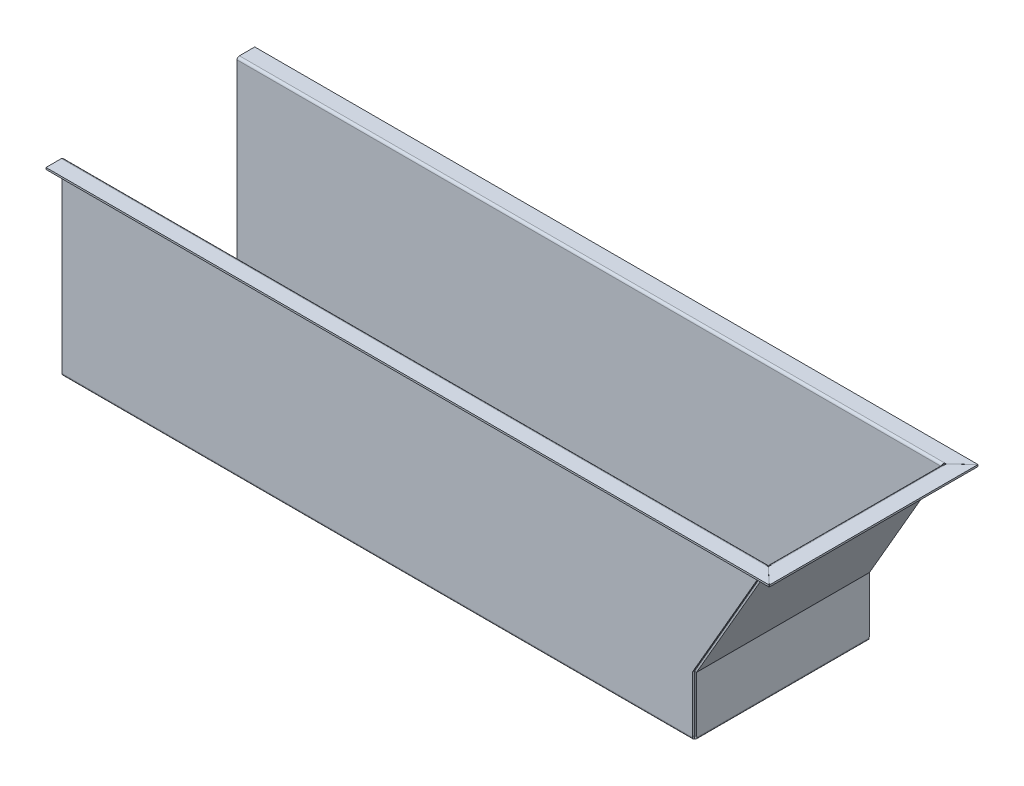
ISO-10303-21;
HEADER;
FILE_DESCRIPTION(('STEP AP214'),'2;1');
FILE_NAME('part.step','',(''),(''),'','','');
FILE_SCHEMA(('AUTOMOTIVE_DESIGN { 1 0 10303 214 1 1 1 1 }'));
ENDSEC;
DATA;
#1=APPLICATION_CONTEXT('core data for automotive mechanical design processes');
#2=APPLICATION_PROTOCOL_DEFINITION('international standard','automotive_design',2000,#1);
#3=PRODUCT_CONTEXT('',#1,'mechanical');
#4=PRODUCT('Part','Part','',(#3));
#5=PRODUCT_RELATED_PRODUCT_CATEGORY('part','',(#4));
#6=PRODUCT_DEFINITION_FORMATION('','',#4);
#7=PRODUCT_DEFINITION_CONTEXT('part definition',#1,'design');
#8=PRODUCT_DEFINITION('design','',#6,#7);
#9=PRODUCT_DEFINITION_SHAPE('','',#8);
#10=(LENGTH_UNIT() NAMED_UNIT(*) SI_UNIT(.MILLI.,.METRE.));
#11=(NAMED_UNIT(*) PLANE_ANGLE_UNIT() SI_UNIT($,.RADIAN.));
#12=(NAMED_UNIT(*) SI_UNIT($,.STERADIAN.) SOLID_ANGLE_UNIT());
#13=UNCERTAINTY_MEASURE_WITH_UNIT(LENGTH_MEASURE(1.E-05),#10,'distance_accuracy_value','');
#14=(GEOMETRIC_REPRESENTATION_CONTEXT(3) GLOBAL_UNCERTAINTY_ASSIGNED_CONTEXT((#13)) GLOBAL_UNIT_ASSIGNED_CONTEXT((#10,
#11,#12)) REPRESENTATION_CONTEXT('',''));
#15=CARTESIAN_POINT('',(0.,0.,0.));
#16=DIRECTION('',(0.,0.,1.));
#17=DIRECTION('',(1.,0.,0.));
#18=AXIS2_PLACEMENT_3D('',#15,#16,#17);
#19=CARTESIAN_POINT('',(1072.43724700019,99.0548306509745,-3.36355339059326));
#20=DIRECTION('',(0.,0.,-1.));
#21=DIRECTION('',(0.500000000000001,0.866025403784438,0.));
#22=AXIS2_PLACEMENT_3D('',#19,#20,#21);
#23=PLANE('',#22);
#24=DIRECTION('',(0.500000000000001,0.866025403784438,0.));
#25=VECTOR('',#24,1.);
#26=CARTESIAN_POINT('',(1072.43724700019,99.0548306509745,-3.36355339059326));
#27=LINE('',#26,#25);
#28=CARTESIAN_POINT('',(1073.1169153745,100.232050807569,-3.36355339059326));
#29=VERTEX_POINT('',#28);
#30=CARTESIAN_POINT('',(1197.97927405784,316.5,-3.36355339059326));
#31=VERTEX_POINT('',#30);
#32=EDGE_CURVE('E936',#29,#31,#27,.T.);
#33=ORIENTED_EDGE('',*,*,#32,.T.);
#34=DIRECTION('',(-0.866025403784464,0.499999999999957,0.));
#35=VECTOR('',#34,1.);
#36=CARTESIAN_POINT('',(1197.97927405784,316.5,-3.36355339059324));
#37=LINE('',#36,#35);
#38=CARTESIAN_POINT('',(1195.38119784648,318.,-3.36355339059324));
#39=VERTEX_POINT('',#38);
#40=EDGE_CURVE('E410',#31,#39,#37,.T.);
#41=ORIENTED_EDGE('',*,*,#40,.T.);
#42=DIRECTION('',(0.500000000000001,0.866025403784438,0.));
#43=VECTOR('',#42,1.);
#44=CARTESIAN_POINT('',(1070.38486456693,101.5,-3.36355339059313));
#45=LINE('',#44,#43);
#46=CARTESIAN_POINT('',(1070.51883916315,101.732050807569,-3.36355339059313));
#47=VERTEX_POINT('',#46);
#48=EDGE_CURVE('E851',#47,#39,#45,.T.);
#49=ORIENTED_EDGE('',*,*,#48,.F.);
#50=DIRECTION('',(0.866025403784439,-0.499999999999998,0.));
#51=VECTOR('',#50,1.);
#52=CARTESIAN_POINT('',(1073.1169153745,100.232050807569,-3.36355339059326));
#53=LINE('',#52,#51);
#54=EDGE_CURVE('E749',#47,#29,#53,.T.);
#55=ORIENTED_EDGE('',*,*,#54,.T.);
#56=EDGE_LOOP('',(#33,#41,#49,#55));
#57=FACE_BOUND('',#56,.T.);
#58=ADVANCED_FACE('F95',(#57),#23,.F.);
#59=CARTESIAN_POINT('',(1072.98294077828,100.,-300.));
#60=DIRECTION('',(0.866025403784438,-0.500000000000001,0.));
#61=DIRECTION('',(0.500000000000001,0.866025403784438,0.));
#62=AXIS2_PLACEMENT_3D('',#59,#60,#61);
#63=PLANE('',#62);
#64=DIRECTION('',(0.500000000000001,0.866025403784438,0.));
#65=VECTOR('',#64,1.);
#66=CARTESIAN_POINT('',(1072.43724700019,99.0548306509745,-296.636446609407));
#67=LINE('',#66,#65);
#68=CARTESIAN_POINT('',(1197.97927405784,316.5,-296.636446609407));
#69=VERTEX_POINT('',#68);
#70=CARTESIAN_POINT('',(1073.1169153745,100.232050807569,-296.636446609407));
#71=VERTEX_POINT('',#70);
#72=EDGE_CURVE('E922',#69,#71,#67,.F.);
#73=ORIENTED_EDGE('',*,*,#72,.F.);
#74=DIRECTION('',(0.,0.,1.));
#75=VECTOR('',#74,1.);
#76=CARTESIAN_POINT('',(1197.97927405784,316.5,-3.36355339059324));
#77=LINE('',#76,#75);
#78=EDGE_CURVE('E118',#31,#69,#77,.F.);
#79=ORIENTED_EDGE('',*,*,#78,.F.);
#80=ORIENTED_EDGE('',*,*,#32,.F.);
#81=DIRECTION('',(0.,0.,1.));
#82=VECTOR('',#81,1.);
#83=CARTESIAN_POINT('',(1073.1169153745,100.232050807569,-296.636446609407));
#84=LINE('',#83,#82);
#85=EDGE_CURVE('E975',#29,#71,#84,.F.);
#86=ORIENTED_EDGE('',*,*,#85,.T.);
#87=EDGE_LOOP('',(#73,#79,#80,#86));
#88=FACE_BOUND('',#87,.T.);
#89=ADVANCED_FACE('F602',(#88),#63,.T.);
#90=CARTESIAN_POINT('',(1070.38486456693,101.5,-300.));
#91=DIRECTION('',(0.866025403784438,-0.500000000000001,0.));
#92=DIRECTION('',(0.500000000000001,0.866025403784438,0.));
#93=AXIS2_PLACEMENT_3D('',#90,#91,#92);
#94=PLANE('',#93);
#95=DIRECTION('',(0.,0.,1.));
#96=VECTOR('',#95,1.);
#97=CARTESIAN_POINT('',(1195.38119784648,318.,-3.36355339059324));
#98=LINE('',#97,#96);
#99=CARTESIAN_POINT('',(1195.38119784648,318.,-296.636446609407));
#100=VERTEX_POINT('',#99);
#101=EDGE_CURVE('E411',#39,#100,#98,.F.);
#102=ORIENTED_EDGE('',*,*,#101,.T.);
#103=DIRECTION('',(0.500000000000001,0.866025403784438,0.));
#104=VECTOR('',#103,1.);
#105=CARTESIAN_POINT('',(1070.38486456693,101.5,-296.636446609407));
#106=LINE('',#105,#104);
#107=CARTESIAN_POINT('',(1070.51883916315,101.732050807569,-296.636446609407));
#108=VERTEX_POINT('',#107);
#109=EDGE_CURVE('E878',#100,#108,#106,.F.);
#110=ORIENTED_EDGE('',*,*,#109,.T.);
#111=DIRECTION('',(0.,0.,1.));
#112=VECTOR('',#111,1.);
#113=CARTESIAN_POINT('',(1070.51883916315,101.732050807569,-300.));
#114=LINE('',#113,#112);
#115=EDGE_CURVE('E830',#47,#108,#114,.F.);
#116=ORIENTED_EDGE('',*,*,#115,.F.);
#117=ORIENTED_EDGE('',*,*,#48,.T.);
#118=EDGE_LOOP('',(#102,#110,#116,#117));
#119=FACE_BOUND('',#118,.T.);
#120=ADVANCED_FACE('F608',(#119),#94,.F.);
#121=CARTESIAN_POINT('',(1069.52432431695,100.736607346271,-300.));
#122=DIRECTION('',(0.866025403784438,-0.500000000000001,0.));
#123=DIRECTION('',(0.500000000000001,0.866025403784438,0.));
#124=AXIS2_PLACEMENT_3D('',#121,#122,#123);
#125=PLANE('',#124);
#126=DIRECTION('',(0.500000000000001,0.866025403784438,0.));
#127=VECTOR('',#126,1.);
#128=CARTESIAN_POINT('',(1069.52432431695,100.736607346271,-300.));
#129=LINE('',#128,#127);
#130=CARTESIAN_POINT('',(1193.80670201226,316.,-300.));
#131=VERTEX_POINT('',#130);
#132=CARTESIAN_POINT('',(1069.75336198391,101.133312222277,-300.));
#133=VERTEX_POINT('',#132);
#134=EDGE_CURVE('E929',#131,#133,#129,.F.);
#135=ORIENTED_EDGE('',*,*,#134,.F.);
#136=DIRECTION('',(0.,1.11022302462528E-13,1.));
#137=VECTOR('',#136,1.);
#138=CARTESIAN_POINT('',(1193.80670201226,316.,-300.));
#139=LINE('',#138,#137);
#140=CARTESIAN_POINT('',(1193.80670201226,316.,-297.));
#141=VERTEX_POINT('',#140);
#142=EDGE_CURVE('E543',#131,#141,#139,.T.);
#143=ORIENTED_EDGE('',*,*,#142,.T.);
#144=DIRECTION('',(0.500000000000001,0.866025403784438,0.));
#145=VECTOR('',#144,1.);
#146=CARTESIAN_POINT('',(1069.52432431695,100.736607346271,-297.));
#147=LINE('',#146,#145);
#148=CARTESIAN_POINT('',(1069.75336198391,101.133312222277,-297.));
#149=VERTEX_POINT('',#148);
#150=EDGE_CURVE('E872',#141,#149,#147,.F.);
#151=ORIENTED_EDGE('',*,*,#150,.T.);
#152=DIRECTION('',(0.,0.,-1.));
#153=VECTOR('',#152,1.);
#154=CARTESIAN_POINT('',(1069.75336198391,101.133312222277,-300.));
#155=LINE('',#154,#153);
#156=EDGE_CURVE('E772',#149,#133,#155,.T.);
#157=ORIENTED_EDGE('',*,*,#156,.T.);
#158=EDGE_LOOP('',(#135,#143,#151,#157));
#159=FACE_BOUND('',#158,.T.);
#160=ADVANCED_FACE('F658',(#159),#125,.T.);
#161=CARTESIAN_POINT('',(0.,0.,-300.));
#162=DIRECTION('',(0.,0.,1.));
#163=DIRECTION('',(1.,0.,0.));
#164=AXIS2_PLACEMENT_3D('',#161,#162,#163);
#165=PLANE('',#164);
#166=DIRECTION('',(1.,0.,0.));
#167=VECTOR('',#166,1.);
#168=CARTESIAN_POINT('',(1196.11610308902,316.,-300.));
#169=LINE('',#168,#167);
#170=CARTESIAN_POINT('',(-2.22044604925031E-13,316.,-300.));
#171=VERTEX_POINT('',#170);
#172=EDGE_CURVE('E549',#131,#171,#169,.F.);
#173=ORIENTED_EDGE('',*,*,#172,.F.);
#174=ORIENTED_EDGE('',*,*,#134,.T.);
#175=CARTESIAN_POINT('',(1070.61938738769,100.633312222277,-300.));
#176=DIRECTION('',(0.,0.,1.));
#177=DIRECTION('',(1.,0.,0.));
#178=AXIS2_PLACEMENT_3D('',#175,#176,#177);
#179=CIRCLE('',#178,1.);
#180=CARTESIAN_POINT('',(1069.61938738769,100.633312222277,-300.));
#181=VERTEX_POINT('',#180);
#182=EDGE_CURVE('E930',#133,#181,#179,.T.);
#183=ORIENTED_EDGE('',*,*,#182,.T.);
#184=DIRECTION('',(0.,1.,0.));
#185=VECTOR('',#184,1.);
#186=CARTESIAN_POINT('',(1069.61938738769,-0.5,-300.));
#187=LINE('',#186,#185);
#188=CARTESIAN_POINT('',(1069.61938738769,5.490399,-300.));
#189=VERTEX_POINT('',#188);
#190=EDGE_CURVE('E926',#181,#189,#187,.F.);
#191=ORIENTED_EDGE('',*,*,#190,.T.);
#192=DIRECTION('',(1.,0.,0.));
#193=VECTOR('',#192,1.);
#194=CARTESIAN_POINT('',(0.,5.490399,-300.));
#195=LINE('',#194,#193);
#196=CARTESIAN_POINT('',(1068.98294077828,5.490399,-300.));
#197=VERTEX_POINT('',#196);
#198=EDGE_CURVE('E956',#197,#189,#195,.T.);
#199=ORIENTED_EDGE('',*,*,#198,.F.);
#200=DIRECTION('',(0.,-1.,0.));
#201=VECTOR('',#200,1.);
#202=CARTESIAN_POINT('',(1068.98294077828,0.,-300.));
#203=LINE('',#202,#201);
#204=CARTESIAN_POINT('',(1068.98294077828,4.,-300.));
#205=VERTEX_POINT('',#204);
#206=EDGE_CURVE('E952',#197,#205,#203,.T.);
#207=ORIENTED_EDGE('',*,*,#206,.T.);
#208=DIRECTION('',(1.,0.,0.));
#209=VECTOR('',#208,1.);
#210=CARTESIAN_POINT('',(0.,4.,-300.));
#211=LINE('',#210,#209);
#212=CARTESIAN_POINT('',(0.,4.00000000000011,-300.));
#213=VERTEX_POINT('',#212);
#214=EDGE_CURVE('E805',#205,#213,#211,.F.);
#215=ORIENTED_EDGE('',*,*,#214,.T.);
#216=DIRECTION('',(0.,-1.,0.));
#217=VECTOR('',#216,1.);
#218=CARTESIAN_POINT('',(0.,320.,-300.));
#219=LINE('',#218,#217);
#220=EDGE_CURVE('E916',#171,#213,#219,.T.);
#221=ORIENTED_EDGE('',*,*,#220,.F.);
#222=EDGE_LOOP('',(#173,#174,#183,#191,#199,#207,#215,#221));
#223=FACE_BOUND('',#222,.T.);
#224=ADVANCED_FACE('F661',(#223),#165,.F.);
#225=CARTESIAN_POINT('',(0.,0.,-297.));
#226=DIRECTION('',(0.,0.,1.));
#227=DIRECTION('',(1.,0.,0.));
#228=AXIS2_PLACEMENT_3D('',#225,#226,#227);
#229=PLANE('',#228);
#230=ORIENTED_EDGE('',*,*,#150,.F.);
#231=DIRECTION('',(1.,0.,0.));
#232=VECTOR('',#231,1.);
#233=CARTESIAN_POINT('',(1196.11610308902,316.,-297.));
#234=LINE('',#233,#232);
#235=CARTESIAN_POINT('',(0.,316.,-297.));
#236=VERTEX_POINT('',#235);
#237=EDGE_CURVE('E544',#141,#236,#234,.F.);
#238=ORIENTED_EDGE('',*,*,#237,.T.);
#239=DIRECTION('',(0.,1.,0.));
#240=VECTOR('',#239,1.);
#241=CARTESIAN_POINT('',(0.,0.,-297.));
#242=LINE('',#241,#240);
#243=CARTESIAN_POINT('',(0.,4.00000000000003,-297.));
#244=VERTEX_POINT('',#243);
#245=EDGE_CURVE('E843',#236,#244,#242,.F.);
#246=ORIENTED_EDGE('',*,*,#245,.T.);
#247=DIRECTION('',(1.,0.,0.));
#248=VECTOR('',#247,1.);
#249=CARTESIAN_POINT('',(0.,4.,-297.));
#250=LINE('',#249,#248);
#251=CARTESIAN_POINT('',(1068.98294077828,4.,-297.));
#252=VERTEX_POINT('',#251);
#253=EDGE_CURVE('E825',#252,#244,#250,.F.);
#254=ORIENTED_EDGE('',*,*,#253,.F.);
#255=DIRECTION('',(0.,1.,0.));
#256=VECTOR('',#255,1.);
#257=CARTESIAN_POINT('',(1068.98294077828,0.,-297.));
#258=LINE('',#257,#256);
#259=CARTESIAN_POINT('',(1068.98294077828,5.490399,-297.));
#260=VERTEX_POINT('',#259);
#261=EDGE_CURVE('E868',#260,#252,#258,.F.);
#262=ORIENTED_EDGE('',*,*,#261,.F.);
#263=DIRECTION('',(1.,0.,0.));
#264=VECTOR('',#263,1.);
#265=CARTESIAN_POINT('',(0.,5.490399,-297.));
#266=LINE('',#265,#264);
#267=CARTESIAN_POINT('',(1069.61938738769,5.490399,-297.));
#268=VERTEX_POINT('',#267);
#269=EDGE_CURVE('E891',#260,#268,#266,.T.);
#270=ORIENTED_EDGE('',*,*,#269,.T.);
#271=DIRECTION('',(0.,1.,0.));
#272=VECTOR('',#271,1.);
#273=CARTESIAN_POINT('',(1069.61938738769,0.,-297.));
#274=LINE('',#273,#272);
#275=CARTESIAN_POINT('',(1069.61938738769,100.633312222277,-297.));
#276=VERTEX_POINT('',#275);
#277=EDGE_CURVE('E898',#276,#268,#274,.F.);
#278=ORIENTED_EDGE('',*,*,#277,.F.);
#279=CARTESIAN_POINT('',(1070.61938738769,100.633312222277,-297.));
#280=DIRECTION('',(0.,0.,1.));
#281=DIRECTION('',(1.,0.,0.));
#282=AXIS2_PLACEMENT_3D('',#279,#280,#281);
#283=CIRCLE('',#282,1.);
#284=EDGE_CURVE('E880',#149,#276,#283,.T.);
#285=ORIENTED_EDGE('',*,*,#284,.F.);
#286=EDGE_LOOP('',(#230,#238,#246,#254,#262,#270,#278,#285));
#287=FACE_BOUND('',#286,.T.);
#288=ADVANCED_FACE('F911',(#287),#229,.T.);
#289=CARTESIAN_POINT('',(1069.52432431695,100.736607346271,0.));
#290=DIRECTION('',(0.866025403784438,-0.500000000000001,0.));
#291=DIRECTION('',(0.500000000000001,0.866025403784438,0.));
#292=AXIS2_PLACEMENT_3D('',#289,#290,#291);
#293=PLANE('',#292);
#294=DIRECTION('',(0.500000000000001,0.866025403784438,0.));
#295=VECTOR('',#294,1.);
#296=CARTESIAN_POINT('',(1069.52432431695,100.736607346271,-3.));
#297=LINE('',#296,#295);
#298=CARTESIAN_POINT('',(1193.80670201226,316.,-3.));
#299=VERTEX_POINT('',#298);
#300=CARTESIAN_POINT('',(1069.75336198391,101.133312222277,-3.));
#301=VERTEX_POINT('',#300);
#302=EDGE_CURVE('E844',#299,#301,#297,.F.);
#303=ORIENTED_EDGE('',*,*,#302,.F.);
#304=DIRECTION('',(0.,-1.11022302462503E-13,-1.));
#305=VECTOR('',#304,1.);
#306=CARTESIAN_POINT('',(1193.80670201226,316.,-1.346579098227E-13));
#307=LINE('',#306,#305);
#308=CARTESIAN_POINT('',(1193.80670201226,316.,0.));
#309=VERTEX_POINT('',#308);
#310=EDGE_CURVE('E724',#309,#299,#307,.T.);
#311=ORIENTED_EDGE('',*,*,#310,.F.);
#312=DIRECTION('',(0.500000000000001,0.866025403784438,0.));
#313=VECTOR('',#312,1.);
#314=CARTESIAN_POINT('',(1069.52432431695,100.736607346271,0.));
#315=LINE('',#314,#313);
#316=CARTESIAN_POINT('',(1069.75336198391,101.133312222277,0.));
#317=VERTEX_POINT('',#316);
#318=EDGE_CURVE('E940',#309,#317,#315,.F.);
#319=ORIENTED_EDGE('',*,*,#318,.T.);
#320=DIRECTION('',(0.,0.,1.));
#321=VECTOR('',#320,1.);
#322=CARTESIAN_POINT('',(1069.75336198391,101.133312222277,0.));
#323=LINE('',#322,#321);
#324=EDGE_CURVE('E728',#301,#317,#323,.T.);
#325=ORIENTED_EDGE('',*,*,#324,.F.);
#326=EDGE_LOOP('',(#303,#311,#319,#325));
#327=FACE_BOUND('',#326,.T.);
#328=ADVANCED_FACE('F1115',(#327),#293,.T.);
#329=CARTESIAN_POINT('',(0.,320.,0.));
#330=DIRECTION('',(-1.,0.,0.));
#331=DIRECTION('',(0.,-1.,0.));
#332=AXIS2_PLACEMENT_3D('',#329,#330,#331);
#333=PLANE('',#332);
#334=DIRECTION('',(0.,-1.,0.));
#335=VECTOR('',#334,1.);
#336=CARTESIAN_POINT('',(0.,320.,0.));
#337=LINE('',#336,#335);
#338=CARTESIAN_POINT('',(0.,316.,0.));
#339=VERTEX_POINT('',#338);
#340=CARTESIAN_POINT('',(0.,4.00000000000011,0.));
#341=VERTEX_POINT('',#340);
#342=EDGE_CURVE('E789',#339,#341,#337,.T.);
#343=ORIENTED_EDGE('',*,*,#342,.F.);
#344=DIRECTION('',(0.,-1.11022302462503E-13,-1.));
#345=VECTOR('',#344,1.);
#346=CARTESIAN_POINT('',(-1.85929804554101E-13,316.,-1.346579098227E-13));
#347=LINE('',#346,#345);
#348=CARTESIAN_POINT('',(-1.85929804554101E-13,315.999999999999,-3.00000000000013));
#349=VERTEX_POINT('',#348);
#350=EDGE_CURVE('E1020',#339,#349,#347,.T.);
#351=ORIENTED_EDGE('',*,*,#350,.T.);
#352=DIRECTION('',(0.,1.,0.));
#353=VECTOR('',#352,1.);
#354=CARTESIAN_POINT('',(0.,0.,-3.));
#355=LINE('',#354,#353);
#356=CARTESIAN_POINT('',(0.,4.00000000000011,-3.));
#357=VERTEX_POINT('',#356);
#358=EDGE_CURVE('E713',#349,#357,#355,.F.);
#359=ORIENTED_EDGE('',*,*,#358,.T.);
#360=DIRECTION('',(0.,0.,1.));
#361=VECTOR('',#360,1.);
#362=CARTESIAN_POINT('',(0.,4.00000000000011,0.));
#363=LINE('',#362,#361);
#364=EDGE_CURVE('E99',#357,#341,#363,.T.);
#365=ORIENTED_EDGE('',*,*,#364,.T.);
#366=EDGE_LOOP('',(#343,#351,#359,#365));
#367=FACE_BOUND('',#366,.T.);
#368=ADVANCED_FACE('F1018',(#367),#333,.T.);
#369=CARTESIAN_POINT('',(0.,0.,0.));
#370=DIRECTION('',(0.,0.,1.));
#371=DIRECTION('',(1.,0.,0.));
#372=AXIS2_PLACEMENT_3D('',#369,#370,#371);
#373=PLANE('',#372);
#374=ORIENTED_EDGE('',*,*,#318,.F.);
#375=DIRECTION('',(-1.,0.,0.));
#376=VECTOR('',#375,1.);
#377=CARTESIAN_POINT('',(-2.22044604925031E-13,316.,-1.346579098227E-13));
#378=LINE('',#377,#376);
#379=EDGE_CURVE('E1015',#339,#309,#378,.F.);
#380=ORIENTED_EDGE('',*,*,#379,.F.);
#381=ORIENTED_EDGE('',*,*,#342,.T.);
#382=DIRECTION('',(1.,0.,0.));
#383=VECTOR('',#382,1.);
#384=CARTESIAN_POINT('',(0.,4.,0.));
#385=LINE('',#384,#383);
#386=CARTESIAN_POINT('',(1068.98294077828,4.,0.));
#387=VERTEX_POINT('',#386);
#388=EDGE_CURVE('E808',#341,#387,#385,.T.);
#389=ORIENTED_EDGE('',*,*,#388,.T.);
#390=DIRECTION('',(0.,1.,0.));
#391=VECTOR('',#390,1.);
#392=CARTESIAN_POINT('',(1068.98294077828,0.,0.));
#393=LINE('',#392,#391);
#394=CARTESIAN_POINT('',(1068.98294077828,5.490399,0.));
#395=VERTEX_POINT('',#394);
#396=EDGE_CURVE('E964',#387,#395,#393,.T.);
#397=ORIENTED_EDGE('',*,*,#396,.T.);
#398=DIRECTION('',(-1.,0.,0.));
#399=VECTOR('',#398,1.);
#400=CARTESIAN_POINT('',(0.,5.490399,0.));
#401=LINE('',#400,#399);
#402=CARTESIAN_POINT('',(1069.61938738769,5.490399,0.));
#403=VERTEX_POINT('',#402);
#404=EDGE_CURVE('E968',#403,#395,#401,.T.);
#405=ORIENTED_EDGE('',*,*,#404,.F.);
#406=DIRECTION('',(0.,1.,0.));
#407=VECTOR('',#406,1.);
#408=CARTESIAN_POINT('',(1069.61938738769,-0.5,0.));
#409=LINE('',#408,#407);
#410=CARTESIAN_POINT('',(1069.61938738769,100.633312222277,0.));
#411=VERTEX_POINT('',#410);
#412=EDGE_CURVE('E937',#411,#403,#409,.F.);
#413=ORIENTED_EDGE('',*,*,#412,.F.);
#414=CARTESIAN_POINT('',(1070.61938738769,100.633312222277,0.));
#415=DIRECTION('',(0.,0.,1.));
#416=DIRECTION('',(1.,0.,0.));
#417=AXIS2_PLACEMENT_3D('',#414,#415,#416);
#418=CIRCLE('',#417,1.);
#419=EDGE_CURVE('E941',#317,#411,#418,.T.);
#420=ORIENTED_EDGE('',*,*,#419,.F.);
#421=EDGE_LOOP('',(#374,#380,#381,#389,#397,#405,#413,#420));
#422=FACE_BOUND('',#421,.T.);
#423=ADVANCED_FACE('F676',(#422),#373,.T.);
#424=CARTESIAN_POINT('',(0.,0.,-3.));
#425=DIRECTION('',(0.,0.,1.));
#426=DIRECTION('',(1.,0.,0.));
#427=AXIS2_PLACEMENT_3D('',#424,#425,#426);
#428=PLANE('',#427);
#429=DIRECTION('',(-1.,0.,0.));
#430=VECTOR('',#429,1.);
#431=CARTESIAN_POINT('',(-2.22044604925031E-13,315.999999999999,-3.00000000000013));
#432=LINE('',#431,#430);
#433=EDGE_CURVE('E1022',#349,#299,#432,.F.);
#434=ORIENTED_EDGE('',*,*,#433,.T.);
#435=ORIENTED_EDGE('',*,*,#302,.T.);
#436=CARTESIAN_POINT('',(1070.61938738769,100.633312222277,-3.));
#437=DIRECTION('',(0.,0.,1.));
#438=DIRECTION('',(1.,0.,0.));
#439=AXIS2_PLACEMENT_3D('',#436,#437,#438);
#440=CIRCLE('',#439,1.);
#441=CARTESIAN_POINT('',(1069.61938738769,100.633312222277,-3.));
#442=VERTEX_POINT('',#441);
#443=EDGE_CURVE('E848',#301,#442,#440,.T.);
#444=ORIENTED_EDGE('',*,*,#443,.T.);
#445=DIRECTION('',(0.,1.,0.));
#446=VECTOR('',#445,1.);
#447=CARTESIAN_POINT('',(1069.61938738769,0.,-3.));
#448=LINE('',#447,#446);
#449=CARTESIAN_POINT('',(1069.61938738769,5.490399,-3.));
#450=VERTEX_POINT('',#449);
#451=EDGE_CURVE('E847',#442,#450,#448,.F.);
#452=ORIENTED_EDGE('',*,*,#451,.T.);
#453=DIRECTION('',(1.,0.,0.));
#454=VECTOR('',#453,1.);
#455=CARTESIAN_POINT('',(0.,5.490399,-3.));
#456=LINE('',#455,#454);
#457=CARTESIAN_POINT('',(1068.98294077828,5.490399,-3.));
#458=VERTEX_POINT('',#457);
#459=EDGE_CURVE('E854',#450,#458,#456,.F.);
#460=ORIENTED_EDGE('',*,*,#459,.T.);
#461=DIRECTION('',(0.,1.,0.));
#462=VECTOR('',#461,1.);
#463=CARTESIAN_POINT('',(1068.98294077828,0.,-3.));
#464=LINE('',#463,#462);
#465=CARTESIAN_POINT('',(1068.98294077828,4.,-3.));
#466=VERTEX_POINT('',#465);
#467=EDGE_CURVE('E837',#466,#458,#464,.T.);
#468=ORIENTED_EDGE('',*,*,#467,.F.);
#469=DIRECTION('',(1.,0.,0.));
#470=VECTOR('',#469,1.);
#471=CARTESIAN_POINT('',(0.,4.00000000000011,-3.));
#472=LINE('',#471,#470);
#473=EDGE_CURVE('E706',#357,#466,#472,.T.);
#474=ORIENTED_EDGE('',*,*,#473,.F.);
#475=ORIENTED_EDGE('',*,*,#358,.F.);
#476=EDGE_LOOP('',(#434,#435,#444,#452,#460,#468,#474,#475));
#477=FACE_BOUND('',#476,.T.);
#478=ADVANCED_FACE('F671',(#477),#428,.F.);
#479=CARTESIAN_POINT('',(0.,0.,-300.));
#480=DIRECTION('',(1.,0.,0.));
#481=DIRECTION('',(0.,0.,1.));
#482=AXIS2_PLACEMENT_3D('',#479,#480,#481);
#483=PLANE('',#482);
#484=DIRECTION('',(0.,-1.,0.));
#485=VECTOR('',#484,1.);
#486=CARTESIAN_POINT('',(0.,0.,-4.));
#487=LINE('',#486,#485);
#488=CARTESIAN_POINT('',(0.,3.,-4.));
#489=VERTEX_POINT('',#488);
#490=CARTESIAN_POINT('',(0.,0.,-4.));
#491=VERTEX_POINT('',#490);
#492=EDGE_CURVE('E13',#489,#491,#487,.T.);
#493=ORIENTED_EDGE('',*,*,#492,.F.);
#494=DIRECTION('',(0.,0.,-1.));
#495=VECTOR('',#494,1.);
#496=CARTESIAN_POINT('',(0.,3.,-300.));
#497=LINE('',#496,#495);
#498=CARTESIAN_POINT('',(0.,3.,-296.));
#499=VERTEX_POINT('',#498);
#500=EDGE_CURVE('E683',#499,#489,#497,.F.);
#501=ORIENTED_EDGE('',*,*,#500,.F.);
#502=DIRECTION('',(0.,-1.,0.));
#503=VECTOR('',#502,1.);
#504=CARTESIAN_POINT('',(0.,0.,-296.));
#505=LINE('',#504,#503);
#506=CARTESIAN_POINT('',(0.,0.,-296.));
#507=VERTEX_POINT('',#506);
#508=EDGE_CURVE('E104',#499,#507,#505,.T.);
#509=ORIENTED_EDGE('',*,*,#508,.T.);
#510=DIRECTION('',(0.,0.,1.));
#511=VECTOR('',#510,1.);
#512=CARTESIAN_POINT('',(0.,0.,-300.));
#513=LINE('',#512,#511);
#514=EDGE_CURVE('E685',#507,#491,#513,.T.);
#515=ORIENTED_EDGE('',*,*,#514,.T.);
#516=EDGE_LOOP('',(#493,#501,#509,#515));
#517=FACE_BOUND('',#516,.T.);
#518=ADVANCED_FACE('F668',(#517),#483,.F.);
#519=CARTESIAN_POINT('',(0.,4.,-296.));
#520=DIRECTION('',(1.,0.,0.));
#521=DIRECTION('',(0.,1.,0.));
#522=AXIS2_PLACEMENT_3D('',#519,#520,#521);
#523=PLANE('',#522);
#524=ORIENTED_EDGE('',*,*,#508,.F.);
#525=CARTESIAN_POINT('',(0.,4.,-296.));
#526=DIRECTION('',(-1.,0.,0.));
#527=DIRECTION('',(0.,0.,1.));
#528=AXIS2_PLACEMENT_3D('',#525,#526,#527);
#529=CIRCLE('',#528,1.);
#530=EDGE_CURVE('E722',#499,#244,#529,.F.);
#531=ORIENTED_EDGE('',*,*,#530,.T.);
#532=DIRECTION('',(0.,0.,-1.));
#533=VECTOR('',#532,1.);
#534=CARTESIAN_POINT('',(0.,4.00000000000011,-300.));
#535=LINE('',#534,#533);
#536=EDGE_CURVE('E775',#244,#213,#535,.T.);
#537=ORIENTED_EDGE('',*,*,#536,.T.);
#538=CARTESIAN_POINT('',(0.,4.,-296.));
#539=DIRECTION('',(-1.,0.,0.));
#540=DIRECTION('',(0.,-1.,0.));
#541=AXIS2_PLACEMENT_3D('',#538,#539,#540);
#542=CIRCLE('',#541,4.);
#543=EDGE_CURVE('E793',#507,#213,#542,.F.);
#544=ORIENTED_EDGE('',*,*,#543,.F.);
#545=EDGE_LOOP('',(#524,#531,#537,#544));
#546=FACE_BOUND('',#545,.T.);
#547=ADVANCED_FACE('F665',(#546),#523,.F.);
#548=CARTESIAN_POINT('',(0.,320.,-300.));
#549=DIRECTION('',(-1.,0.,0.));
#550=DIRECTION('',(0.,-1.,0.));
#551=AXIS2_PLACEMENT_3D('',#548,#549,#550);
#552=PLANE('',#551);
#553=DIRECTION('',(0.,1.11022302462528E-13,1.));
#554=VECTOR('',#553,1.);
#555=CARTESIAN_POINT('',(-2.22044604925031E-13,316.,-300.));
#556=LINE('',#555,#554);
#557=EDGE_CURVE('E553',#171,#236,#556,.T.);
#558=ORIENTED_EDGE('',*,*,#557,.F.);
#559=ORIENTED_EDGE('',*,*,#220,.T.);
#560=ORIENTED_EDGE('',*,*,#536,.F.);
#561=ORIENTED_EDGE('',*,*,#245,.F.);
#562=EDGE_LOOP('',(#558,#559,#560,#561));
#563=FACE_BOUND('',#562,.T.);
#564=ADVANCED_FACE('F656',(#563),#552,.T.);
#565=CARTESIAN_POINT('',(1070.61938738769,100.633312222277,-300.));
#566=DIRECTION('',(0.,0.,1.));
#567=DIRECTION('',(1.,0.,0.));
#568=AXIS2_PLACEMENT_3D('',#565,#566,#567);
#569=CYLINDRICAL_SURFACE('',#568,1.);
#570=ORIENTED_EDGE('',*,*,#156,.F.);
#571=ORIENTED_EDGE('',*,*,#284,.T.);
#572=DIRECTION('',(0.,0.,-1.));
#573=VECTOR('',#572,1.);
#574=CARTESIAN_POINT('',(1069.61938738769,100.633312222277,-300.));
#575=LINE('',#574,#573);
#576=EDGE_CURVE('E770',#276,#181,#575,.T.);
#577=ORIENTED_EDGE('',*,*,#576,.T.);
#578=ORIENTED_EDGE('',*,*,#182,.F.);
#579=EDGE_LOOP('',(#570,#571,#577,#578));
#580=FACE_BOUND('',#579,.T.);
#581=ADVANCED_FACE('F652',(#580),#569,.F.);
#582=CARTESIAN_POINT('',(1069.61938738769,-0.5,-300.));
#583=DIRECTION('',(1.,0.,0.));
#584=DIRECTION('',(0.,1.,0.));
#585=AXIS2_PLACEMENT_3D('',#582,#583,#584);
#586=PLANE('',#585);
#587=ORIENTED_EDGE('',*,*,#576,.F.);
#588=ORIENTED_EDGE('',*,*,#277,.T.);
#589=DIRECTION('',(0.,0.,-1.));
#590=VECTOR('',#589,1.);
#591=CARTESIAN_POINT('',(1069.61938738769,5.490399,-300.));
#592=LINE('',#591,#590);
#593=EDGE_CURVE('E768',#268,#189,#592,.T.);
#594=ORIENTED_EDGE('',*,*,#593,.T.);
#595=ORIENTED_EDGE('',*,*,#190,.F.);
#596=EDGE_LOOP('',(#587,#588,#594,#595));
#597=FACE_BOUND('',#596,.T.);
#598=ADVANCED_FACE('F648',(#597),#586,.T.);
#599=CARTESIAN_POINT('',(0.,5.490399,-300.));
#600=DIRECTION('',(0.,-1.,0.));
#601=DIRECTION('',(1.,0.,0.));
#602=AXIS2_PLACEMENT_3D('',#599,#600,#601);
#603=PLANE('',#602);
#604=ORIENTED_EDGE('',*,*,#593,.F.);
#605=ORIENTED_EDGE('',*,*,#269,.F.);
#606=DIRECTION('',(0.,0.,-1.));
#607=VECTOR('',#606,1.);
#608=CARTESIAN_POINT('',(1068.98294077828,5.490399,-300.));
#609=LINE('',#608,#607);
#610=EDGE_CURVE('E766',#260,#197,#609,.T.);
#611=ORIENTED_EDGE('',*,*,#610,.T.);
#612=ORIENTED_EDGE('',*,*,#198,.T.);
#613=EDGE_LOOP('',(#604,#605,#611,#612));
#614=FACE_BOUND('',#613,.T.);
#615=ADVANCED_FACE('F644',(#614),#603,.T.);
#616=CARTESIAN_POINT('',(1068.98294077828,0.,-300.));
#617=DIRECTION('',(-1.,0.,0.));
#618=DIRECTION('',(0.,-1.,0.));
#619=AXIS2_PLACEMENT_3D('',#616,#617,#618);
#620=PLANE('',#619);
#621=ORIENTED_EDGE('',*,*,#610,.F.);
#622=ORIENTED_EDGE('',*,*,#261,.T.);
#623=DIRECTION('',(0.,0.,-1.));
#624=VECTOR('',#623,1.);
#625=CARTESIAN_POINT('',(1068.98294077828,4.,-300.));
#626=LINE('',#625,#624);
#627=EDGE_CURVE('E764',#252,#205,#626,.T.);
#628=ORIENTED_EDGE('',*,*,#627,.T.);
#629=ORIENTED_EDGE('',*,*,#206,.F.);
#630=EDGE_LOOP('',(#621,#622,#628,#629));
#631=FACE_BOUND('',#630,.T.);
#632=ADVANCED_FACE('F640',(#631),#620,.F.);
#633=CARTESIAN_POINT('',(1068.98294077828,4.,-296.));
#634=DIRECTION('',(1.,0.,0.));
#635=DIRECTION('',(0.,0.,-1.));
#636=AXIS2_PLACEMENT_3D('',#633,#634,#635);
#637=PLANE('',#636);
#638=ORIENTED_EDGE('',*,*,#627,.F.);
#639=CARTESIAN_POINT('',(1068.98294077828,4.,-296.));
#640=DIRECTION('',(-1.,0.,0.));
#641=DIRECTION('',(0.,0.,1.));
#642=AXIS2_PLACEMENT_3D('',#639,#640,#641);
#643=CIRCLE('',#642,1.);
#644=CARTESIAN_POINT('',(1068.98294077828,3.,-296.));
#645=VERTEX_POINT('',#644);
#646=EDGE_CURVE('E719',#252,#645,#643,.T.);
#647=ORIENTED_EDGE('',*,*,#646,.T.);
#648=DIRECTION('',(0.,-1.,0.));
#649=VECTOR('',#648,1.);
#650=CARTESIAN_POINT('',(1068.98294077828,0.,-296.));
#651=LINE('',#650,#649);
#652=CARTESIAN_POINT('',(1068.98294077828,0.,-296.));
#653=VERTEX_POINT('',#652);
#654=EDGE_CURVE('E762',#645,#653,#651,.T.);
#655=ORIENTED_EDGE('',*,*,#654,.T.);
#656=CARTESIAN_POINT('',(1068.98294077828,4.,-296.));
#657=DIRECTION('',(-1.,0.,0.));
#658=DIRECTION('',(0.,0.,1.));
#659=AXIS2_PLACEMENT_3D('',#656,#657,#658);
#660=CIRCLE('',#659,4.);
#661=EDGE_CURVE('E799',#205,#653,#660,.T.);
#662=ORIENTED_EDGE('',*,*,#661,.F.);
#663=EDGE_LOOP('',(#638,#647,#655,#662));
#664=FACE_BOUND('',#663,.T.);
#665=ADVANCED_FACE('F636',(#664),#637,.T.);
#666=CARTESIAN_POINT('',(1068.98294077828,4.,-296.));
#667=DIRECTION('',(0.,0.,1.));
#668=DIRECTION('',(1.,0.,0.));
#669=AXIS2_PLACEMENT_3D('',#666,#667,#668);
#670=PLANE('',#669);
#671=ORIENTED_EDGE('',*,*,#654,.F.);
#672=CARTESIAN_POINT('',(1068.98294077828,4.,-296.));
#673=DIRECTION('',(0.,0.,1.));
#674=DIRECTION('',(1.,0.,0.));
#675=AXIS2_PLACEMENT_3D('',#672,#673,#674);
#676=CIRCLE('',#675,1.);
#677=CARTESIAN_POINT('',(1069.98294077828,4.,-296.));
#678=VERTEX_POINT('',#677);
#679=EDGE_CURVE('E862',#645,#678,#676,.T.);
#680=ORIENTED_EDGE('',*,*,#679,.T.);
#681=DIRECTION('',(1.,0.,0.));
#682=VECTOR('',#681,1.);
#683=CARTESIAN_POINT('',(1072.98294077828,4.,-296.));
#684=LINE('',#683,#682);
#685=CARTESIAN_POINT('',(1072.98294077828,4.,-296.));
#686=VERTEX_POINT('',#685);
#687=EDGE_CURVE('E760',#678,#686,#684,.T.);
#688=ORIENTED_EDGE('',*,*,#687,.T.);
#689=CARTESIAN_POINT('',(1068.98294077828,4.,-296.));
#690=DIRECTION('',(0.,0.,-1.));
#691=DIRECTION('',(-1.,0.,0.));
#692=AXIS2_PLACEMENT_3D('',#689,#690,#691);
#693=CIRCLE('',#692,4.);
#694=EDGE_CURVE('E814',#653,#686,#693,.F.);
#695=ORIENTED_EDGE('',*,*,#694,.F.);
#696=EDGE_LOOP('',(#671,#680,#688,#695));
#697=FACE_BOUND('',#696,.T.);
#698=ADVANCED_FACE('F632',(#697),#670,.F.);
#699=CARTESIAN_POINT('',(1072.98294077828,0.,-296.));
#700=DIRECTION('',(0.,0.,1.));
#701=DIRECTION('',(0.,-1.,0.));
#702=AXIS2_PLACEMENT_3D('',#699,#700,#701);
#703=PLANE('',#702);
#704=ORIENTED_EDGE('',*,*,#687,.F.);
#705=DIRECTION('',(0.,1.,0.));
#706=VECTOR('',#705,1.);
#707=CARTESIAN_POINT('',(1069.98294077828,0.,-296.));
#708=LINE('',#707,#706);
#709=CARTESIAN_POINT('',(1069.98294077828,5.490399,-296.));
#710=VERTEX_POINT('',#709);
#711=EDGE_CURVE('E888',#710,#678,#708,.F.);
#712=ORIENTED_EDGE('',*,*,#711,.F.);
#713=DIRECTION('',(1.,0.,0.));
#714=VECTOR('',#713,1.);
#715=CARTESIAN_POINT('',(1072.98294077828,5.490399,-296.));
#716=LINE('',#715,#714);
#717=CARTESIAN_POINT('',(1072.98294077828,5.490399,-296.));
#718=VERTEX_POINT('',#717);
#719=EDGE_CURVE('E758',#710,#718,#716,.T.);
#720=ORIENTED_EDGE('',*,*,#719,.T.);
#721=DIRECTION('',(0.,-1.,0.));
#722=VECTOR('',#721,1.);
#723=CARTESIAN_POINT('',(1072.98294077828,0.,-296.));
#724=LINE('',#723,#722);
#725=EDGE_CURVE('E951',#718,#686,#724,.T.);
#726=ORIENTED_EDGE('',*,*,#725,.T.);
#727=EDGE_LOOP('',(#704,#712,#720,#726));
#728=FACE_BOUND('',#727,.T.);
#729=ADVANCED_FACE('F628',(#728),#703,.F.);
#730=CARTESIAN_POINT('',(1072.98294077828,5.490399,-300.));
#731=DIRECTION('',(0.,-1.,0.));
#732=DIRECTION('',(0.,0.,-1.));
#733=AXIS2_PLACEMENT_3D('',#730,#731,#732);
#734=PLANE('',#733);
#735=ORIENTED_EDGE('',*,*,#719,.F.);
#736=DIRECTION('',(0.,0.,-1.));
#737=VECTOR('',#736,1.);
#738=CARTESIAN_POINT('',(1069.98294077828,5.490399,-300.));
#739=LINE('',#738,#737);
#740=CARTESIAN_POINT('',(1069.98294077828,5.490399,-296.636446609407));
#741=VERTEX_POINT('',#740);
#742=EDGE_CURVE('E846',#710,#741,#739,.T.);
#743=ORIENTED_EDGE('',*,*,#742,.T.);
#744=DIRECTION('',(1.,0.,0.));
#745=VECTOR('',#744,1.);
#746=CARTESIAN_POINT('',(1072.98294077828,5.490399,-296.636446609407));
#747=LINE('',#746,#745);
#748=CARTESIAN_POINT('',(1072.98294077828,5.490399,-296.636446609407));
#749=VERTEX_POINT('',#748);
#750=EDGE_CURVE('E756',#741,#749,#747,.T.);
#751=ORIENTED_EDGE('',*,*,#750,.T.);
#752=DIRECTION('',(0.,0.,-1.));
#753=VECTOR('',#752,1.);
#754=CARTESIAN_POINT('',(1072.98294077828,5.490399,-300.));
#755=LINE('',#754,#753);
#756=EDGE_CURVE('E944',#718,#749,#755,.T.);
#757=ORIENTED_EDGE('',*,*,#756,.F.);
#758=EDGE_LOOP('',(#735,#743,#751,#757));
#759=FACE_BOUND('',#758,.T.);
#760=ADVANCED_FACE('F624',(#759),#734,.T.);
#761=CARTESIAN_POINT('',(1072.98294077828,-0.5,-296.636446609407));
#762=DIRECTION('',(0.,0.,-1.));
#763=DIRECTION('',(0.,1.,0.));
#764=AXIS2_PLACEMENT_3D('',#761,#762,#763);
#765=PLANE('',#764);
#766=ORIENTED_EDGE('',*,*,#750,.F.);
#767=DIRECTION('',(0.,1.,0.));
#768=VECTOR('',#767,1.);
#769=CARTESIAN_POINT('',(1069.98294077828,0.,-296.636446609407));
#770=LINE('',#769,#768);
#771=CARTESIAN_POINT('',(1069.98294077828,99.7320508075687,-296.636446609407));
#772=VERTEX_POINT('',#771);
#773=EDGE_CURVE('E881',#772,#741,#770,.F.);
#774=ORIENTED_EDGE('',*,*,#773,.F.);
#775=DIRECTION('',(1.,0.,0.));
#776=VECTOR('',#775,1.);
#777=CARTESIAN_POINT('',(1072.98294077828,99.7320508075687,-296.636446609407));
#778=LINE('',#777,#776);
#779=CARTESIAN_POINT('',(1072.98294077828,99.7320508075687,-296.636446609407));
#780=VERTEX_POINT('',#779);
#781=EDGE_CURVE('E754',#772,#780,#778,.T.);
#782=ORIENTED_EDGE('',*,*,#781,.T.);
#783=DIRECTION('',(0.,1.,0.));
#784=VECTOR('',#783,1.);
#785=CARTESIAN_POINT('',(1072.98294077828,-0.5,-296.636446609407));
#786=LINE('',#785,#784);
#787=EDGE_CURVE('E919',#780,#749,#786,.F.);
#788=ORIENTED_EDGE('',*,*,#787,.T.);
#789=EDGE_LOOP('',(#766,#774,#782,#788));
#790=FACE_BOUND('',#789,.T.);
#791=ADVANCED_FACE('F620',(#790),#765,.T.);
#792=CARTESIAN_POINT('',(1073.98294077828,99.7320508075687,-296.636446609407));
#793=DIRECTION('',(0.,0.,-1.));
#794=DIRECTION('',(-1.,0.,0.));
#795=AXIS2_PLACEMENT_3D('',#792,#793,#794);
#796=PLANE('',#795);
#797=ORIENTED_EDGE('',*,*,#781,.F.);
#798=CARTESIAN_POINT('',(1073.98294077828,99.7320508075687,-296.636446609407));
#799=DIRECTION('',(0.,0.,-1.));
#800=DIRECTION('',(-1.,0.,0.));
#801=AXIS2_PLACEMENT_3D('',#798,#799,#800);
#802=CIRCLE('',#801,4.);
#803=EDGE_CURVE('E714',#772,#108,#802,.T.);
#804=ORIENTED_EDGE('',*,*,#803,.T.);
#805=DIRECTION('',(0.866025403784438,-0.500000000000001,0.));
#806=VECTOR('',#805,1.);
#807=CARTESIAN_POINT('',(1073.1169153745,100.232050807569,-296.636446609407));
#808=LINE('',#807,#806);
#809=EDGE_CURVE('E751',#108,#71,#808,.T.);
#810=ORIENTED_EDGE('',*,*,#809,.T.);
#811=CARTESIAN_POINT('',(1073.98294077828,99.7320508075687,-296.636446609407));
#812=DIRECTION('',(0.,0.,1.));
#813=DIRECTION('',(1.,0.,0.));
#814=AXIS2_PLACEMENT_3D('',#811,#812,#813);
#815=CIRCLE('',#814,1.);
#816=EDGE_CURVE('E790',#780,#71,#815,.F.);
#817=ORIENTED_EDGE('',*,*,#816,.F.);
#818=EDGE_LOOP('',(#797,#804,#810,#817));
#819=FACE_BOUND('',#818,.T.);
#820=ADVANCED_FACE('F617',(#819),#796,.T.);
#821=CARTESIAN_POINT('',(1072.43724700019,99.0548306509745,-296.636446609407));
#822=DIRECTION('',(0.,0.,-1.));
#823=DIRECTION('',(0.500000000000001,0.866025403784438,0.));
#824=AXIS2_PLACEMENT_3D('',#821,#822,#823);
#825=PLANE('',#824);
#826=DIRECTION('',(-0.866025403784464,0.499999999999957,0.));
#827=VECTOR('',#826,1.);
#828=CARTESIAN_POINT('',(1197.97927405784,316.5,-296.636446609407));
#829=LINE('',#828,#827);
#830=EDGE_CURVE('E111',#69,#100,#829,.T.);
#831=ORIENTED_EDGE('',*,*,#830,.F.);
#832=ORIENTED_EDGE('',*,*,#72,.T.);
#833=ORIENTED_EDGE('',*,*,#809,.F.);
#834=ORIENTED_EDGE('',*,*,#109,.F.);
#835=EDGE_LOOP('',(#831,#832,#833,#834));
#836=FACE_BOUND('',#835,.T.);
#837=ADVANCED_FACE('F614',(#836),#825,.T.);
#838=CARTESIAN_POINT('',(1073.98294077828,99.7320508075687,-3.36355339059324));
#839=DIRECTION('',(0.,0.,1.));
#840=DIRECTION('',(1.,0.,0.));
#841=AXIS2_PLACEMENT_3D('',#838,#839,#840);
#842=PLANE('',#841);
#843=ORIENTED_EDGE('',*,*,#54,.F.);
#844=CARTESIAN_POINT('',(1073.98294077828,99.7320508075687,-3.36355339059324));
#845=DIRECTION('',(0.,0.,-1.));
#846=DIRECTION('',(-1.,0.,0.));
#847=AXIS2_PLACEMENT_3D('',#844,#845,#846);
#848=CIRCLE('',#847,4.);
#849=CARTESIAN_POINT('',(1069.98294077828,99.7320508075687,-3.36355339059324));
#850=VERTEX_POINT('',#849);
#851=EDGE_CURVE('E873',#47,#850,#848,.F.);
#852=ORIENTED_EDGE('',*,*,#851,.T.);
#853=DIRECTION('',(1.,0.,0.));
#854=VECTOR('',#853,1.);
#855=CARTESIAN_POINT('',(1072.98294077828,99.7320508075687,-3.36355339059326));
#856=LINE('',#855,#854);
#857=CARTESIAN_POINT('',(1072.98294077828,99.7320508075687,-3.36355339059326));
#858=VERTEX_POINT('',#857);
#859=EDGE_CURVE('E747',#850,#858,#856,.T.);
#860=ORIENTED_EDGE('',*,*,#859,.T.);
#861=CARTESIAN_POINT('',(1073.98294077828,99.7320508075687,-3.36355339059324));
#862=DIRECTION('',(0.,0.,-1.));
#863=DIRECTION('',(-1.,0.,0.));
#864=AXIS2_PLACEMENT_3D('',#861,#862,#863);
#865=CIRCLE('',#864,1.);
#866=EDGE_CURVE('E978',#29,#858,#865,.F.);
#867=ORIENTED_EDGE('',*,*,#866,.F.);
#868=EDGE_LOOP('',(#843,#852,#860,#867));
#869=FACE_BOUND('',#868,.T.);
#870=ADVANCED_FACE('F612',(#869),#842,.T.);
#871=CARTESIAN_POINT('',(1072.98294077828,-0.5,-3.36355339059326));
#872=DIRECTION('',(0.,0.,-1.));
#873=DIRECTION('',(0.,1.,0.));
#874=AXIS2_PLACEMENT_3D('',#871,#872,#873);
#875=PLANE('',#874);
#876=ORIENTED_EDGE('',*,*,#859,.F.);
#877=DIRECTION('',(0.,1.,0.));
#878=VECTOR('',#877,1.);
#879=CARTESIAN_POINT('',(1069.98294077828,0.,-3.36355339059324));
#880=LINE('',#879,#878);
#881=CARTESIAN_POINT('',(1069.98294077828,5.490399,-3.36355339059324));
#882=VERTEX_POINT('',#881);
#883=EDGE_CURVE('E869',#882,#850,#880,.T.);
#884=ORIENTED_EDGE('',*,*,#883,.F.);
#885=DIRECTION('',(1.,0.,0.));
#886=VECTOR('',#885,1.);
#887=CARTESIAN_POINT('',(1072.98294077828,5.490399,-3.36355339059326));
#888=LINE('',#887,#886);
#889=CARTESIAN_POINT('',(1072.98294077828,5.490399,-3.36355339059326));
#890=VERTEX_POINT('',#889);
#891=EDGE_CURVE('E745',#882,#890,#888,.T.);
#892=ORIENTED_EDGE('',*,*,#891,.T.);
#893=DIRECTION('',(0.,1.,0.));
#894=VECTOR('',#893,1.);
#895=CARTESIAN_POINT('',(1072.98294077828,-0.5,-3.36355339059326));
#896=LINE('',#895,#894);
#897=EDGE_CURVE('E933',#890,#858,#896,.T.);
#898=ORIENTED_EDGE('',*,*,#897,.T.);
#899=EDGE_LOOP('',(#876,#884,#892,#898));
#900=FACE_BOUND('',#899,.T.);
#901=ADVANCED_FACE('F1159',(#900),#875,.F.);
#902=CARTESIAN_POINT('',(1072.98294077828,5.490399,-300.));
#903=DIRECTION('',(0.,1.,0.));
#904=DIRECTION('',(0.,0.,1.));
#905=AXIS2_PLACEMENT_3D('',#902,#903,#904);
#906=PLANE('',#905);
#907=ORIENTED_EDGE('',*,*,#891,.F.);
#908=DIRECTION('',(0.,0.,-1.));
#909=VECTOR('',#908,1.);
#910=CARTESIAN_POINT('',(1069.98294077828,5.490399,-300.));
#911=LINE('',#910,#909);
#912=CARTESIAN_POINT('',(1069.98294077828,5.490399,-4.));
#913=VERTEX_POINT('',#912);
#914=EDGE_CURVE('E865',#913,#882,#911,.F.);
#915=ORIENTED_EDGE('',*,*,#914,.F.);
#916=DIRECTION('',(1.,0.,0.));
#917=VECTOR('',#916,1.);
#918=CARTESIAN_POINT('',(1072.98294077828,5.490399,-4.));
#919=LINE('',#918,#917);
#920=CARTESIAN_POINT('',(1072.98294077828,5.490399,-4.));
#921=VERTEX_POINT('',#920);
#922=EDGE_CURVE('E743',#913,#921,#919,.T.);
#923=ORIENTED_EDGE('',*,*,#922,.T.);
#924=DIRECTION('',(0.,0.,1.));
#925=VECTOR('',#924,1.);
#926=CARTESIAN_POINT('',(1072.98294077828,5.490399,-300.));
#927=LINE('',#926,#925);
#928=EDGE_CURVE('E955',#921,#890,#927,.T.);
#929=ORIENTED_EDGE('',*,*,#928,.T.);
#930=EDGE_LOOP('',(#907,#915,#923,#929));
#931=FACE_BOUND('',#930,.T.);
#932=ADVANCED_FACE('F1157',(#931),#906,.F.);
#933=CARTESIAN_POINT('',(1072.98294077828,0.,-3.99999999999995));
#934=DIRECTION('',(0.,0.,1.));
#935=DIRECTION('',(0.,-1.,0.));
#936=AXIS2_PLACEMENT_3D('',#933,#934,#935);
#937=PLANE('',#936);
#938=ORIENTED_EDGE('',*,*,#922,.F.);
#939=DIRECTION('',(0.,1.,0.));
#940=VECTOR('',#939,1.);
#941=CARTESIAN_POINT('',(1069.98294077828,0.,-4.));
#942=LINE('',#941,#940);
#943=CARTESIAN_POINT('',(1069.98294077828,4.,-3.99999999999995));
#944=VERTEX_POINT('',#943);
#945=EDGE_CURVE('E857',#913,#944,#942,.F.);
#946=ORIENTED_EDGE('',*,*,#945,.T.);
#947=DIRECTION('',(1.,0.,0.));
#948=VECTOR('',#947,1.);
#949=CARTESIAN_POINT('',(1072.98294077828,4.,-3.99999999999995));
#950=LINE('',#949,#948);
#951=CARTESIAN_POINT('',(1072.98294077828,4.,-3.99999999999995));
#952=VERTEX_POINT('',#951);
#953=EDGE_CURVE('E741',#944,#952,#950,.T.);
#954=ORIENTED_EDGE('',*,*,#953,.T.);
#955=DIRECTION('',(0.,-1.,0.));
#956=VECTOR('',#955,1.);
#957=CARTESIAN_POINT('',(1072.98294077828,0.,-3.99999999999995));
#958=LINE('',#957,#956);
#959=EDGE_CURVE('E963',#921,#952,#958,.T.);
#960=ORIENTED_EDGE('',*,*,#959,.F.);
#961=EDGE_LOOP('',(#938,#946,#954,#960));
#962=FACE_BOUND('',#961,.T.);
#963=ADVANCED_FACE('F1154',(#962),#937,.T.);
#964=CARTESIAN_POINT('',(1068.98294077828,4.,-3.99999999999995));
#965=DIRECTION('',(0.,0.,-1.));
#966=DIRECTION('',(-1.,0.,0.));
#967=AXIS2_PLACEMENT_3D('',#964,#965,#966);
#968=PLANE('',#967);
#969=ORIENTED_EDGE('',*,*,#953,.F.);
#970=CARTESIAN_POINT('',(1068.98294077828,4.,-3.99999999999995));
#971=DIRECTION('',(0.,0.,1.));
#972=DIRECTION('',(1.,0.,0.));
#973=AXIS2_PLACEMENT_3D('',#970,#971,#972);
#974=CIRCLE('',#973,1.);
#975=CARTESIAN_POINT('',(1068.98294077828,3.,-4.));
#976=VERTEX_POINT('',#975);
#977=EDGE_CURVE('E860',#944,#976,#974,.F.);
#978=ORIENTED_EDGE('',*,*,#977,.T.);
#979=DIRECTION('',(0.,-1.,0.));
#980=VECTOR('',#979,1.);
#981=CARTESIAN_POINT('',(1068.98294077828,0.,-4.));
#982=LINE('',#981,#980);
#983=CARTESIAN_POINT('',(1068.98294077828,0.,-4.));
#984=VERTEX_POINT('',#983);
#985=EDGE_CURVE('E739',#976,#984,#982,.T.);
#986=ORIENTED_EDGE('',*,*,#985,.T.);
#987=CARTESIAN_POINT('',(1068.98294077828,4.,-3.99999999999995));
#988=DIRECTION('',(0.,0.,1.));
#989=DIRECTION('',(1.,0.,0.));
#990=AXIS2_PLACEMENT_3D('',#987,#988,#989);
#991=CIRCLE('',#990,4.);
#992=EDGE_CURVE('E798',#952,#984,#991,.F.);
#993=ORIENTED_EDGE('',*,*,#992,.F.);
#994=EDGE_LOOP('',(#969,#978,#986,#993));
#995=FACE_BOUND('',#994,.T.);
#996=ADVANCED_FACE('F1000',(#995),#968,.F.);
#997=CARTESIAN_POINT('',(1068.98294077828,4.,-4.));
#998=DIRECTION('',(-1.,0.,0.));
#999=DIRECTION('',(0.,0.,1.));
#1000=AXIS2_PLACEMENT_3D('',#997,#998,#999);
#1001=PLANE('',#1000);
#1002=ORIENTED_EDGE('',*,*,#985,.F.);
#1003=CARTESIAN_POINT('',(1068.98294077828,4.,-4.));
#1004=DIRECTION('',(1.,0.,0.));
#1005=DIRECTION('',(0.,0.,-1.));
#1006=AXIS2_PLACEMENT_3D('',#1003,#1004,#1005);
#1007=CIRCLE('',#1006,1.);
#1008=EDGE_CURVE('E700',#976,#466,#1007,.F.);
#1009=ORIENTED_EDGE('',*,*,#1008,.T.);
#1010=DIRECTION('',(0.,0.,1.));
#1011=VECTOR('',#1010,1.);
#1012=CARTESIAN_POINT('',(1068.98294077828,4.,0.));
#1013=LINE('',#1012,#1011);
#1014=EDGE_CURVE('E737',#466,#387,#1013,.T.);
#1015=ORIENTED_EDGE('',*,*,#1014,.T.);
#1016=CARTESIAN_POINT('',(1068.98294077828,4.,-4.));
#1017=DIRECTION('',(1.,0.,0.));
#1018=DIRECTION('',(0.,0.,-1.));
#1019=AXIS2_PLACEMENT_3D('',#1016,#1017,#1018);
#1020=CIRCLE('',#1019,4.);
#1021=EDGE_CURVE('E705',#984,#387,#1020,.F.);
#1022=ORIENTED_EDGE('',*,*,#1021,.F.);
#1023=EDGE_LOOP('',(#1002,#1009,#1015,#1022));
#1024=FACE_BOUND('',#1023,.T.);
#1025=ADVANCED_FACE('F1004',(#1024),#1001,.F.);
#1026=CARTESIAN_POINT('',(1068.98294077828,0.,0.));
#1027=DIRECTION('',(1.,0.,0.));
#1028=DIRECTION('',(0.,1.,0.));
#1029=AXIS2_PLACEMENT_3D('',#1026,#1027,#1028);
#1030=PLANE('',#1029);
#1031=ORIENTED_EDGE('',*,*,#1014,.F.);
#1032=ORIENTED_EDGE('',*,*,#467,.T.);
#1033=DIRECTION('',(0.,0.,1.));
#1034=VECTOR('',#1033,1.);
#1035=CARTESIAN_POINT('',(1068.98294077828,5.490399,0.));
#1036=LINE('',#1035,#1034);
#1037=EDGE_CURVE('E735',#458,#395,#1036,.T.);
#1038=ORIENTED_EDGE('',*,*,#1037,.T.);
#1039=ORIENTED_EDGE('',*,*,#396,.F.);
#1040=EDGE_LOOP('',(#1031,#1032,#1038,#1039));
#1041=FACE_BOUND('',#1040,.T.);
#1042=ADVANCED_FACE('F1145',(#1041),#1030,.T.);
#1043=CARTESIAN_POINT('',(0.,5.490399,0.));
#1044=DIRECTION('',(0.,1.,0.));
#1045=DIRECTION('',(-1.,0.,0.));
#1046=AXIS2_PLACEMENT_3D('',#1043,#1044,#1045);
#1047=PLANE('',#1046);
#1048=ORIENTED_EDGE('',*,*,#1037,.F.);
#1049=ORIENTED_EDGE('',*,*,#459,.F.);
#1050=DIRECTION('',(0.,0.,1.));
#1051=VECTOR('',#1050,1.);
#1052=CARTESIAN_POINT('',(1069.61938738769,5.490399,0.));
#1053=LINE('',#1052,#1051);
#1054=EDGE_CURVE('E733',#450,#403,#1053,.T.);
#1055=ORIENTED_EDGE('',*,*,#1054,.T.);
#1056=ORIENTED_EDGE('',*,*,#404,.T.);
#1057=EDGE_LOOP('',(#1048,#1049,#1055,#1056));
#1058=FACE_BOUND('',#1057,.T.);
#1059=ADVANCED_FACE('F1141',(#1058),#1047,.F.);
#1060=CARTESIAN_POINT('',(1069.61938738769,-0.5,0.));
#1061=DIRECTION('',(1.,0.,0.));
#1062=DIRECTION('',(0.,1.,0.));
#1063=AXIS2_PLACEMENT_3D('',#1060,#1061,#1062);
#1064=PLANE('',#1063);
#1065=ORIENTED_EDGE('',*,*,#1054,.F.);
#1066=ORIENTED_EDGE('',*,*,#451,.F.);
#1067=DIRECTION('',(0.,0.,1.));
#1068=VECTOR('',#1067,1.);
#1069=CARTESIAN_POINT('',(1069.61938738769,100.633312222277,0.));
#1070=LINE('',#1069,#1068);
#1071=EDGE_CURVE('E731',#442,#411,#1070,.T.);
#1072=ORIENTED_EDGE('',*,*,#1071,.T.);
#1073=ORIENTED_EDGE('',*,*,#412,.T.);
#1074=EDGE_LOOP('',(#1065,#1066,#1072,#1073));
#1075=FACE_BOUND('',#1074,.T.);
#1076=ADVANCED_FACE('F1137',(#1075),#1064,.T.);
#1077=CARTESIAN_POINT('',(1070.61938738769,100.633312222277,0.));
#1078=DIRECTION('',(0.,0.,1.));
#1079=DIRECTION('',(1.,0.,0.));
#1080=AXIS2_PLACEMENT_3D('',#1077,#1078,#1079);
#1081=CYLINDRICAL_SURFACE('',#1080,1.);
#1082=ORIENTED_EDGE('',*,*,#1071,.F.);
#1083=ORIENTED_EDGE('',*,*,#443,.F.);
#1084=ORIENTED_EDGE('',*,*,#324,.T.);
#1085=ORIENTED_EDGE('',*,*,#419,.T.);
#1086=EDGE_LOOP('',(#1082,#1083,#1084,#1085));
#1087=FACE_BOUND('',#1086,.T.);
#1088=ADVANCED_FACE('F1091',(#1087),#1081,.F.);
#1089=CARTESIAN_POINT('',(0.,4.,-4.));
#1090=DIRECTION('',(-1.,0.,0.));
#1091=DIRECTION('',(0.,-1.,0.));
#1092=AXIS2_PLACEMENT_3D('',#1089,#1090,#1091);
#1093=PLANE('',#1092);
#1094=CARTESIAN_POINT('',(0.,4.,-4.));
#1095=DIRECTION('',(1.,0.,0.));
#1096=DIRECTION('',(0.,0.,-1.));
#1097=AXIS2_PLACEMENT_3D('',#1094,#1095,#1096);
#1098=CIRCLE('',#1097,1.);
#1099=EDGE_CURVE('E698',#357,#489,#1098,.T.);
#1100=ORIENTED_EDGE('',*,*,#1099,.T.);
#1101=ORIENTED_EDGE('',*,*,#492,.T.);
#1102=CARTESIAN_POINT('',(0.,4.,-4.));
#1103=DIRECTION('',(1.,0.,0.));
#1104=DIRECTION('',(0.,1.,0.));
#1105=AXIS2_PLACEMENT_3D('',#1102,#1103,#1104);
#1106=CIRCLE('',#1105,4.);
#1107=EDGE_CURVE('E817',#341,#491,#1106,.T.);
#1108=ORIENTED_EDGE('',*,*,#1107,.F.);
#1109=ORIENTED_EDGE('',*,*,#364,.F.);
#1110=EDGE_LOOP('',(#1100,#1101,#1108,#1109));
#1111=FACE_BOUND('',#1110,.T.);
#1112=ADVANCED_FACE('F97',(#1111),#1093,.T.);
#1113=CARTESIAN_POINT('',(1072.98294077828,0.,-300.));
#1114=DIRECTION('',(1.,0.,0.));
#1115=DIRECTION('',(0.,0.,-1.));
#1116=AXIS2_PLACEMENT_3D('',#1113,#1114,#1115);
#1117=PLANE('',#1116);
#1118=ORIENTED_EDGE('',*,*,#959,.T.);
#1119=DIRECTION('',(0.,0.,1.));
#1120=VECTOR('',#1119,1.);
#1121=CARTESIAN_POINT('',(1072.98294077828,4.,-300.));
#1122=LINE('',#1121,#1120);
#1123=EDGE_CURVE('E806',#952,#686,#1122,.F.);
#1124=ORIENTED_EDGE('',*,*,#1123,.T.);
#1125=ORIENTED_EDGE('',*,*,#725,.F.);
#1126=ORIENTED_EDGE('',*,*,#756,.T.);
#1127=ORIENTED_EDGE('',*,*,#787,.F.);
#1128=DIRECTION('',(0.,0.,1.));
#1129=VECTOR('',#1128,1.);
#1130=CARTESIAN_POINT('',(1072.98294077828,99.7320508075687,-3.36355339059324));
#1131=LINE('',#1130,#1129);
#1132=EDGE_CURVE('E967',#780,#858,#1131,.T.);
#1133=ORIENTED_EDGE('',*,*,#1132,.T.);
#1134=ORIENTED_EDGE('',*,*,#897,.F.);
#1135=ORIENTED_EDGE('',*,*,#928,.F.);
#1136=EDGE_LOOP('',(#1118,#1124,#1125,#1126,#1127,#1133,#1134,#1135));
#1137=FACE_BOUND('',#1136,.T.);
#1138=ADVANCED_FACE('F994',(#1137),#1117,.T.);
#1139=CARTESIAN_POINT('',(0.,0.,-300.));
#1140=DIRECTION('',(0.,-1.,0.));
#1141=DIRECTION('',(0.,0.,-1.));
#1142=AXIS2_PLACEMENT_3D('',#1139,#1140,#1141);
#1143=PLANE('',#1142);
#1144=DIRECTION('',(0.,0.,1.));
#1145=VECTOR('',#1144,1.);
#1146=CARTESIAN_POINT('',(1068.98294077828,0.,-300.));
#1147=LINE('',#1146,#1145);
#1148=EDGE_CURVE('E811',#653,#984,#1147,.T.);
#1149=ORIENTED_EDGE('',*,*,#1148,.T.);
#1150=DIRECTION('',(1.,0.,0.));
#1151=VECTOR('',#1150,1.);
#1152=CARTESIAN_POINT('',(0.,0.,-4.));
#1153=LINE('',#1152,#1151);
#1154=EDGE_CURVE('E788',#984,#491,#1153,.F.);
#1155=ORIENTED_EDGE('',*,*,#1154,.T.);
#1156=ORIENTED_EDGE('',*,*,#514,.F.);
#1157=DIRECTION('',(1.,0.,0.));
#1158=VECTOR('',#1157,1.);
#1159=CARTESIAN_POINT('',(1068.98294077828,0.,-296.));
#1160=LINE('',#1159,#1158);
#1161=EDGE_CURVE('E785',#507,#653,#1160,.T.);
#1162=ORIENTED_EDGE('',*,*,#1161,.T.);
#1163=EDGE_LOOP('',(#1149,#1155,#1156,#1162));
#1164=FACE_BOUND('',#1163,.T.);
#1165=ADVANCED_FACE('F783',(#1164),#1143,.T.);
#1166=CARTESIAN_POINT('',(1073.98294077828,99.7320508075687,-300.));
#1167=DIRECTION('',(0.,0.,-1.));
#1168=DIRECTION('',(-1.,0.,0.));
#1169=AXIS2_PLACEMENT_3D('',#1166,#1167,#1168);
#1170=CYLINDRICAL_SURFACE('',#1169,1.);
#1171=ORIENTED_EDGE('',*,*,#816,.T.);
#1172=ORIENTED_EDGE('',*,*,#85,.F.);
#1173=ORIENTED_EDGE('',*,*,#866,.T.);
#1174=ORIENTED_EDGE('',*,*,#1132,.F.);
#1175=EDGE_LOOP('',(#1171,#1172,#1173,#1174));
#1176=FACE_BOUND('',#1175,.T.);
#1177=ADVANCED_FACE('F1089',(#1176),#1170,.F.);
#1178=CARTESIAN_POINT('',(1068.98294077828,4.,-300.));
#1179=DIRECTION('',(0.,0.,1.));
#1180=DIRECTION('',(1.,0.,0.));
#1181=AXIS2_PLACEMENT_3D('',#1178,#1179,#1180);
#1182=CYLINDRICAL_SURFACE('',#1181,4.);
#1183=ORIENTED_EDGE('',*,*,#694,.T.);
#1184=ORIENTED_EDGE('',*,*,#1123,.F.);
#1185=ORIENTED_EDGE('',*,*,#992,.T.);
#1186=ORIENTED_EDGE('',*,*,#1148,.F.);
#1187=EDGE_LOOP('',(#1183,#1184,#1185,#1186));
#1188=FACE_BOUND('',#1187,.T.);
#1189=ADVANCED_FACE('F989',(#1188),#1182,.T.);
#1190=CARTESIAN_POINT('',(0.,4.,-296.));
#1191=DIRECTION('',(-1.,0.,0.));
#1192=DIRECTION('',(0.,0.,1.));
#1193=AXIS2_PLACEMENT_3D('',#1190,#1191,#1192);
#1194=CYLINDRICAL_SURFACE('',#1193,4.);
#1195=ORIENTED_EDGE('',*,*,#543,.T.);
#1196=ORIENTED_EDGE('',*,*,#214,.F.);
#1197=ORIENTED_EDGE('',*,*,#661,.T.);
#1198=ORIENTED_EDGE('',*,*,#1161,.F.);
#1199=EDGE_LOOP('',(#1195,#1196,#1197,#1198));
#1200=FACE_BOUND('',#1199,.T.);
#1201=ADVANCED_FACE('F802',(#1200),#1194,.T.);
#1202=CARTESIAN_POINT('',(0.,4.,-4.));
#1203=DIRECTION('',(1.,0.,0.));
#1204=DIRECTION('',(0.,0.,-1.));
#1205=AXIS2_PLACEMENT_3D('',#1202,#1203,#1204);
#1206=CYLINDRICAL_SURFACE('',#1205,4.);
#1207=ORIENTED_EDGE('',*,*,#1107,.T.);
#1208=ORIENTED_EDGE('',*,*,#1154,.F.);
#1209=ORIENTED_EDGE('',*,*,#1021,.T.);
#1210=ORIENTED_EDGE('',*,*,#388,.F.);
#1211=EDGE_LOOP('',(#1207,#1208,#1209,#1210));
#1212=FACE_BOUND('',#1211,.T.);
#1213=ADVANCED_FACE('F1009',(#1212),#1206,.T.);
#1214=CARTESIAN_POINT('',(1069.98294077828,0.,-300.));
#1215=DIRECTION('',(1.,0.,0.));
#1216=DIRECTION('',(0.,0.,-1.));
#1217=AXIS2_PLACEMENT_3D('',#1214,#1215,#1216);
#1218=PLANE('',#1217);
#1219=ORIENTED_EDGE('',*,*,#945,.F.);
#1220=ORIENTED_EDGE('',*,*,#914,.T.);
#1221=ORIENTED_EDGE('',*,*,#883,.T.);
#1222=DIRECTION('',(0.,0.,-1.));
#1223=VECTOR('',#1222,1.);
#1224=CARTESIAN_POINT('',(1069.98294077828,99.7320508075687,-300.));
#1225=LINE('',#1224,#1223);
#1226=EDGE_CURVE('E834',#772,#850,#1225,.F.);
#1227=ORIENTED_EDGE('',*,*,#1226,.F.);
#1228=ORIENTED_EDGE('',*,*,#773,.T.);
#1229=ORIENTED_EDGE('',*,*,#742,.F.);
#1230=ORIENTED_EDGE('',*,*,#711,.T.);
#1231=DIRECTION('',(0.,0.,-1.));
#1232=VECTOR('',#1231,1.);
#1233=CARTESIAN_POINT('',(1069.98294077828,4.,-300.));
#1234=LINE('',#1233,#1232);
#1235=EDGE_CURVE('E829',#944,#678,#1234,.T.);
#1236=ORIENTED_EDGE('',*,*,#1235,.F.);
#1237=EDGE_LOOP('',(#1219,#1220,#1221,#1227,#1228,#1229,#1230,#1236));
#1238=FACE_BOUND('',#1237,.T.);
#1239=ADVANCED_FACE('F1105',(#1238),#1218,.F.);
#1240=CARTESIAN_POINT('',(0.,3.,-300.));
#1241=DIRECTION('',(0.,-1.,0.));
#1242=DIRECTION('',(0.,0.,-1.));
#1243=AXIS2_PLACEMENT_3D('',#1240,#1241,#1242);
#1244=PLANE('',#1243);
#1245=DIRECTION('',(0.,0.,-1.));
#1246=VECTOR('',#1245,1.);
#1247=CARTESIAN_POINT('',(1068.98294077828,3.,-300.));
#1248=LINE('',#1247,#1246);
#1249=EDGE_CURVE('E827',#645,#976,#1248,.F.);
#1250=ORIENTED_EDGE('',*,*,#1249,.F.);
#1251=DIRECTION('',(1.,0.,0.));
#1252=VECTOR('',#1251,1.);
#1253=CARTESIAN_POINT('',(0.,3.,-296.));
#1254=LINE('',#1253,#1252);
#1255=EDGE_CURVE('E711',#499,#645,#1254,.T.);
#1256=ORIENTED_EDGE('',*,*,#1255,.F.);
#1257=ORIENTED_EDGE('',*,*,#500,.T.);
#1258=DIRECTION('',(1.,0.,0.));
#1259=VECTOR('',#1258,1.);
#1260=CARTESIAN_POINT('',(0.,3.,-4.));
#1261=LINE('',#1260,#1259);
#1262=EDGE_CURVE('E695',#976,#489,#1261,.F.);
#1263=ORIENTED_EDGE('',*,*,#1262,.F.);
#1264=EDGE_LOOP('',(#1250,#1256,#1257,#1263));
#1265=FACE_BOUND('',#1264,.T.);
#1266=ADVANCED_FACE('F709',(#1265),#1244,.F.);
#1267=CARTESIAN_POINT('',(1073.98294077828,99.7320508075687,-300.));
#1268=DIRECTION('',(0.,0.,-1.));
#1269=DIRECTION('',(-1.,0.,0.));
#1270=AXIS2_PLACEMENT_3D('',#1267,#1268,#1269);
#1271=CYLINDRICAL_SURFACE('',#1270,4.);
#1272=ORIENTED_EDGE('',*,*,#803,.F.);
#1273=ORIENTED_EDGE('',*,*,#1226,.T.);
#1274=ORIENTED_EDGE('',*,*,#851,.F.);
#1275=ORIENTED_EDGE('',*,*,#115,.T.);
#1276=EDGE_LOOP('',(#1272,#1273,#1274,#1275));
#1277=FACE_BOUND('',#1276,.T.);
#1278=ADVANCED_FACE('F1112',(#1277),#1271,.T.);
#1279=CARTESIAN_POINT('',(1068.98294077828,4.,-300.));
#1280=DIRECTION('',(0.,0.,1.));
#1281=DIRECTION('',(1.,0.,0.));
#1282=AXIS2_PLACEMENT_3D('',#1279,#1280,#1281);
#1283=CYLINDRICAL_SURFACE('',#1282,1.);
#1284=ORIENTED_EDGE('',*,*,#679,.F.);
#1285=ORIENTED_EDGE('',*,*,#1249,.T.);
#1286=ORIENTED_EDGE('',*,*,#977,.F.);
#1287=ORIENTED_EDGE('',*,*,#1235,.T.);
#1288=EDGE_LOOP('',(#1284,#1285,#1286,#1287));
#1289=FACE_BOUND('',#1288,.T.);
#1290=ADVANCED_FACE('F1121',(#1289),#1283,.F.);
#1291=CARTESIAN_POINT('',(0.,4.,-296.));
#1292=DIRECTION('',(-1.,0.,0.));
#1293=DIRECTION('',(0.,0.,1.));
#1294=AXIS2_PLACEMENT_3D('',#1291,#1292,#1293);
#1295=CYLINDRICAL_SURFACE('',#1294,1.);
#1296=ORIENTED_EDGE('',*,*,#530,.F.);
#1297=ORIENTED_EDGE('',*,*,#1255,.T.);
#1298=ORIENTED_EDGE('',*,*,#646,.F.);
#1299=ORIENTED_EDGE('',*,*,#253,.T.);
#1300=EDGE_LOOP('',(#1296,#1297,#1298,#1299));
#1301=FACE_BOUND('',#1300,.T.);
#1302=ADVANCED_FACE('F905',(#1301),#1295,.F.);
#1303=CARTESIAN_POINT('',(0.,4.,-4.));
#1304=DIRECTION('',(1.,0.,0.));
#1305=DIRECTION('',(0.,0.,-1.));
#1306=AXIS2_PLACEMENT_3D('',#1303,#1304,#1305);
#1307=CYLINDRICAL_SURFACE('',#1306,1.);
#1308=ORIENTED_EDGE('',*,*,#1099,.F.);
#1309=ORIENTED_EDGE('',*,*,#473,.T.);
#1310=ORIENTED_EDGE('',*,*,#1008,.F.);
#1311=ORIENTED_EDGE('',*,*,#1262,.T.);
#1312=EDGE_LOOP('',(#1308,#1309,#1310,#1311));
#1313=FACE_BOUND('',#1312,.T.);
#1314=ADVANCED_FACE('F696',(#1313),#1307,.F.);
#1315=CARTESIAN_POINT('',(1193.80670201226,316.,-3.03000000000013));
#1316=CARTESIAN_POINT('',(1193.99918286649,316.527609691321,-3.03000000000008));
#1317=CARTESIAN_POINT('',(1194.19160219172,317.054843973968,-2.92510988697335));
#1318=CARTESIAN_POINT('',(1194.57650237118,318.029584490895,-2.52135914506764));
#1319=CARTESIAN_POINT('',(1194.76895246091,318.476623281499,-2.22265737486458));
#1320=CARTESIAN_POINT('',(1195.15385264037,319.222657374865,-1.47662328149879));
#1321=CARTESIAN_POINT('',(1195.3463027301,319.521359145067,-1.02958449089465));
#1322=CARTESIAN_POINT('',(1195.73120290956,319.925109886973,-0.0548439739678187));
#1323=CARTESIAN_POINT('',(1195.92362223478,320.03,0.472390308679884));
#1324=CARTESIAN_POINT('',(1196.11610308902,320.03,1.00000000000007));
#1325=CARTESIAN_POINT('',(1193.80670201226,316.,-3.00000000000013));
#1326=CARTESIAN_POINT('',(1193.99918267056,316.523681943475,-3.00000000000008));
#1327=CARTESIAN_POINT('',(1194.19160219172,317.046991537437,-2.89589070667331));
#1328=CARTESIAN_POINT('',(1194.57650237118,318.014475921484,-2.49514555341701));
#1329=CARTESIAN_POINT('',(1194.76895246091,318.4581868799,-2.19866736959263));
#1330=CARTESIAN_POINT('',(1195.15385264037,319.198667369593,-1.45818687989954));
#1331=CARTESIAN_POINT('',(1195.3463027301,319.495145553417,-1.01447592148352));
#1332=CARTESIAN_POINT('',(1195.73120290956,319.895890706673,-0.0469915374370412));
#1333=CARTESIAN_POINT('',(1195.92362243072,320.,0.476318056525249));
#1334=CARTESIAN_POINT('',(1196.11610308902,320.,1.00000000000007));
#1335=CARTESIAN_POINT('',(1193.80670201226,316.,-1.346579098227E-13));
#1336=CARTESIAN_POINT('',(1193.99916307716,316.130907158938,-1.2013135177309E-13));
#1337=CARTESIAN_POINT('',(1194.19160219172,316.261747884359,0.0260273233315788));
#1338=CARTESIAN_POINT('',(1194.57650237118,316.503618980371,0.126213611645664));
#1339=CARTESIAN_POINT('',(1194.76895246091,316.614546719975,0.200333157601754));
#1340=CARTESIAN_POINT('',(1195.15385264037,316.799666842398,0.385453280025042));
#1341=CARTESIAN_POINT('',(1195.3463027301,316.873786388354,0.496381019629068));
#1342=CARTESIAN_POINT('',(1195.73120290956,316.973972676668,0.738252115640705));
#1343=CARTESIAN_POINT('',(1195.92364202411,317.,0.869092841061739));
#1344=CARTESIAN_POINT('',(1196.11610308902,317.,1.));
#1345=CARTESIAN_POINT('',(1193.80670201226,316.,0.0302999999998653));
#1346=CARTESIAN_POINT('',(1193.99916287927,316.126940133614,0.0302999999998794));
#1347=CARTESIAN_POINT('',(1194.19160219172,316.253816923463,0.0555386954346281));
#1348=CARTESIAN_POINT('',(1194.57650237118,316.488359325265,0.152689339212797));
#1349=CARTESIAN_POINT('',(1194.76895246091,316.59592595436,0.224563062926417));
#1350=CARTESIAN_POINT('',(1195.15385264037,316.775436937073,0.404074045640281));
#1351=CARTESIAN_POINT('',(1195.3463027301,316.847310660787,0.511640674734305));
#1352=CARTESIAN_POINT('',(1195.73120290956,316.944461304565,0.74618307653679));
#1353=CARTESIAN_POINT('',(1195.923642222,316.9697,0.873059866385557));
#1354=CARTESIAN_POINT('',(1196.11610308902,316.9697,1.));
#1355=B_SPLINE_SURFACE_WITH_KNOTS('',1,3,((#1315,#1316,#1317,#1318,#1319,#1320,#1321,#1322,
#1323,#1324),(#1325,#1326,#1327,#1328,#1329,#1330,#1331,#1332,#1333,#1334),(#1335,#1336,#1337,
#1338,#1339,#1340,#1341,#1342,#1343,#1344),(#1345,#1346,#1347,#1348,#1349,#1350,#1351,#1352,
#1353,#1354)),.UNSPECIFIED.,.F.,.F.,.F.,(2,1,1,2),(4,2,2,2,4),(-0.01,0.,1.,1.0101),(0.,0.25,0.5,
0.75,1.),.UNSPECIFIED.);
#1356=DIRECTION('',(0.,-1.,0.));
#1357=VECTOR('',#1356,1.);
#1358=CARTESIAN_POINT('',(1196.11610308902,320.,0.999999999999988));
#1359=LINE('',#1358,#1357);
#1360=CARTESIAN_POINT('',(1196.11610308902,317.,0.999999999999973));
#1361=VERTEX_POINT('',#1360);
#1362=CARTESIAN_POINT('',(1196.11610308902,320.,0.999999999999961));
#1363=VERTEX_POINT('',#1362);
#1364=EDGE_CURVE('E556',#1361,#1363,#1359,.F.);
#1365=CARTESIAN_POINT('',(1193.80670201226,316.,-1.346579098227E-13));
#1366=CARTESIAN_POINT('',(1193.87689009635,316.047739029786,-2.55395490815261E-05));
#1367=CARTESIAN_POINT('',(1193.94707568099,316.095475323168,0.00341713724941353));
#1368=CARTESIAN_POINT('',(1194.08743521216,316.18996831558,0.0170571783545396));
#1369=CARTESIAN_POINT('',(1194.15760915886,316.236725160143,0.0272535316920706));
#1370=CARTESIAN_POINT('',(1194.29779372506,316.328191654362,0.0541873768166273));
#1371=CARTESIAN_POINT('',(1194.36780433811,316.37290588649,0.0709093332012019));
#1372=CARTESIAN_POINT('',(1194.50782288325,316.459499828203,0.110547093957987));
#1373=CARTESIAN_POINT('',(1194.57783081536,316.501379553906,0.133462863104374));
#1374=CARTESIAN_POINT('',(1194.72182368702,316.583724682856,0.186490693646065));
#1375=CARTESIAN_POINT('',(1194.79580880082,316.623974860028,0.216937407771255));
#1376=CARTESIAN_POINT('',(1194.94378207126,316.699436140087,0.283534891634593));
#1377=CARTESIAN_POINT('',(1195.01777022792,316.734647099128,0.319685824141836));
#1378=CARTESIAN_POINT('',(1195.16568751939,316.799208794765,0.39684773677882));
#1379=CARTESIAN_POINT('',(1195.2396166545,316.828564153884,0.43785484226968));
#1380=CARTESIAN_POINT('',(1195.38744750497,316.880770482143,0.523793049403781));
#1381=CARTESIAN_POINT('',(1195.46134922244,316.903623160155,0.568723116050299));
#1382=CARTESIAN_POINT('',(1195.63203944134,316.948297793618,0.675878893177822));
#1383=CARTESIAN_POINT('',(1195.72884156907,316.96761780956,0.739157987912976));
#1384=CARTESIAN_POINT('',(1195.87401483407,316.987008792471,0.835980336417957));
#1385=CARTESIAN_POINT('',(1195.92242290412,316.991874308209,0.868586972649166));
#1386=CARTESIAN_POINT('',(1196.01925061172,316.998371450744,0.934126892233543));
#1387=CARTESIAN_POINT('',(1196.06767024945,317.000002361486,0.967060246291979));
#1388=CARTESIAN_POINT('',(1196.11610308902,317.,1.));
#1389=B_SPLINE_CURVE_WITH_KNOTS('',3,(#1365,#1366,#1367,#1368,#1369,#1370,#1371,#1372,#1373,
#1374,#1375,#1376,#1377,#1378,#1379,#1380,#1381,#1382,#1383,#1384,#1385,#1386,#1387,#1388),
.UNSPECIFIED.,.F.,.F.,(4,2,2,2,2,2,2,2,2,2,2,4),(0.,0.254578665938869,0.509119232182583,
0.76305747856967,1.01699428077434,1.28534557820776,1.55370453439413,1.82185079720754,
2.08992652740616,2.44086330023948,2.61649122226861,2.79215801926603),.UNSPECIFIED.);
#1390=EDGE_CURVE('E1040',#309,#1361,#1389,.T.);
#1391=CARTESIAN_POINT('',(1193.80670201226,316.,-3.00000000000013));
#1392=CARTESIAN_POINT('',(1193.85106371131,316.120689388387,-3.00001601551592));
#1393=CARTESIAN_POINT('',(1193.89542431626,316.241376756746,-2.99453845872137));
#1394=CARTESIAN_POINT('',(1193.98414136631,316.481759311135,-2.97271164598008));
#1395=CARTESIAN_POINT('',(1194.0284978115,316.601454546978,-2.95636293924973));
#1396=CARTESIAN_POINT('',(1194.1171709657,316.838775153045,-2.91292790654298));
#1397=CARTESIAN_POINT('',(1194.16148767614,316.956402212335,-2.88585081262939));
#1398=CARTESIAN_POINT('',(1194.25012427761,317.188726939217,-2.82118629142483));
#1399=CARTESIAN_POINT('',(1194.29444416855,317.303424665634,-2.78359907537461));
#1400=CARTESIAN_POINT('',(1194.38281958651,317.528285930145,-2.69847387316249));
#1401=CARTESIAN_POINT('',(1194.42687511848,317.638472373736,-2.65099638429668));
#1402=CARTESIAN_POINT('',(1194.51500203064,317.854177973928,-2.54632211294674));
#1403=CARTESIAN_POINT('',(1194.55907341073,317.959695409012,-2.48912178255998));
#1404=CARTESIAN_POINT('',(1194.6471844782,318.165102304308,-2.36551488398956));
#1405=CARTESIAN_POINT('',(1194.69122416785,318.264995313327,-2.29911421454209));
#1406=CARTESIAN_POINT('',(1194.77932215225,318.458451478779,-2.15759163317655));
#1407=CARTESIAN_POINT('',(1194.82338044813,318.552012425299,-2.08246670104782));
#1408=CARTESIAN_POINT('',(1194.91148620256,318.731988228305,-1.92414108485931));
#1409=CARTESIAN_POINT('',(1194.95553366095,318.818404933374,-1.84094250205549));
#1410=CARTESIAN_POINT('',(1195.04362926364,318.983421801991,-1.6671249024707));
#1411=CARTESIAN_POINT('',(1195.08767740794,319.062021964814,-1.57650588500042));
#1412=CARTESIAN_POINT('',(1195.17579707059,319.21081826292,-1.38851933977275));
#1413=CARTESIAN_POINT('',(1195.21986858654,319.281009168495,-1.29114767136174));
#1414=CARTESIAN_POINT('',(1195.30799711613,319.412339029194,-1.09052893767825));
#1415=CARTESIAN_POINT('',(1195.3520541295,319.473481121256,-0.987283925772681));
#1416=CARTESIAN_POINT('',(1195.44020865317,319.586296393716,-0.775632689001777));
#1417=CARTESIAN_POINT('',(1195.48430616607,319.63796148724,-0.667222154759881));
#1418=CARTESIAN_POINT('',(1195.57248449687,319.731323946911,-0.446237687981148));
#1419=CARTESIAN_POINT('',(1195.61656531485,319.773025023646,-0.333665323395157));
#1420=CARTESIAN_POINT('',(1195.70467964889,319.846110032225,-0.105346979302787));
#1421=CARTESIAN_POINT('',(1195.74871316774,319.877504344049,0.0103956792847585));
#1422=CARTESIAN_POINT('',(1195.83676145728,319.929769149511,0.244187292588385));
#1423=CARTESIAN_POINT('',(1195.8807762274,319.950644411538,0.36223517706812));
#1424=CARTESIAN_POINT('',(1195.95670118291,319.977449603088,0.567060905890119));
#1425=CARTESIAN_POINT('',(1195.98861325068,319.985910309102,0.653515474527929));
#1426=CARTESIAN_POINT('',(1196.05238369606,319.997182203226,0.826644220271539));
#1427=CARTESIAN_POINT('',(1196.08424207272,320.000002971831,0.913317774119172));
#1428=CARTESIAN_POINT('',(1196.11610308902,320.,1.00000000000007));
#1429=B_SPLINE_CURVE_WITH_KNOTS('',3,(#1391,#1392,#1393,#1394,#1395,#1396,#1397,#1398,#1399,
#1400,#1401,#1402,#1403,#1404,#1405,#1406,#1407,#1408,#1409,#1410,#1411,#1412,#1413,#1414,#1415,
#1416,#1417,#1418,#1419,#1420,#1421,#1422,#1423,#1424,#1425,#1426,#1427,#1428),.UNSPECIFIED.,
.F.,.F.,(4,2,2,2,2,2,2,2,2,2,2,2,2,2,2,2,2,2,4),(0.,0.385632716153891,0.771245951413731,
1.15652807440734,1.54180245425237,1.92478595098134,2.30790950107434,2.69078854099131,
3.07380052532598,3.4567130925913,3.83962569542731,4.22277520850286,4.60579158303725,
4.98913328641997,5.37233201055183,5.7551436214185,6.13778154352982,6.41524902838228,
6.69224478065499),.UNSPECIFIED.);
#1430=EDGE_CURVE('E1031',#299,#1363,#1429,.T.);
#1431=ORIENTED_EDGE('',*,*,#1364,.F.);
#1432=ORIENTED_EDGE('',*,*,#1390,.F.);
#1433=ORIENTED_EDGE('',*,*,#310,.T.);
#1434=ORIENTED_EDGE('',*,*,#1430,.T.);
#1435=EDGE_LOOP('',(#1431,#1432,#1433,#1434));
#1436=FACE_BOUND('',#1435,.T.);
#1437=ADVANCED_FACE('F1063',(#1436),#1355,.F.);
#1438=CARTESIAN_POINT('',(-1.85929804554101E-13,316.,0.999999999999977));
#1439=DIRECTION('',(1.,0.,0.));
#1440=DIRECTION('',(0.,0.,-1.));
#1441=AXIS2_PLACEMENT_3D('',#1438,#1439,#1440);
#1442=PLANE('',#1441);
#1443=CARTESIAN_POINT('',(-1.85929804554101E-13,316.,0.999999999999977));
#1444=DIRECTION('',(-1.,0.,0.));
#1445=DIRECTION('',(0.,0.,1.));
#1446=AXIS2_PLACEMENT_3D('',#1443,#1444,#1445);
#1447=CIRCLE('',#1446,1.00000000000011);
#1448=CARTESIAN_POINT('',(-1.85929804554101E-13,317.,0.999999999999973));
#1449=VERTEX_POINT('',#1448);
#1450=EDGE_CURVE('E1047',#1449,#339,#1447,.T.);
#1451=ORIENTED_EDGE('',*,*,#1450,.F.);
#1452=DIRECTION('',(0.,-1.,0.));
#1453=VECTOR('',#1452,1.);
#1454=CARTESIAN_POINT('',(-2.22044604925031E-13,317.,0.999999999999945));
#1455=LINE('',#1454,#1453);
#1456=CARTESIAN_POINT('',(-1.30697110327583E-13,320.,0.999999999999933));
#1457=VERTEX_POINT('',#1456);
#1458=EDGE_CURVE('E1038',#1449,#1457,#1455,.F.);
#1459=ORIENTED_EDGE('',*,*,#1458,.T.);
#1460=CARTESIAN_POINT('',(-1.85929804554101E-13,316.,0.999999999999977));
#1461=DIRECTION('',(-1.,0.,0.));
#1462=DIRECTION('',(0.,0.,1.));
#1463=AXIS2_PLACEMENT_3D('',#1460,#1461,#1462);
#1464=CIRCLE('',#1463,4.00000000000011);
#1465=EDGE_CURVE('E1029',#1457,#349,#1464,.T.);
#1466=ORIENTED_EDGE('',*,*,#1465,.T.);
#1467=ORIENTED_EDGE('',*,*,#350,.F.);
#1468=EDGE_LOOP('',(#1451,#1459,#1466,#1467));
#1469=FACE_BOUND('',#1468,.T.);
#1470=ADVANCED_FACE('F1035',(#1469),#1442,.F.);
#1471=CARTESIAN_POINT('',(-2.22044604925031E-13,316.,0.999999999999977));
#1472=DIRECTION('',(-1.,0.,0.));
#1473=DIRECTION('',(0.,1.,0.));
#1474=AXIS2_PLACEMENT_3D('',#1471,#1472,#1473);
#1475=CYLINDRICAL_SURFACE('',#1474,4.00000000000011);
#1476=ORIENTED_EDGE('',*,*,#433,.F.);
#1477=ORIENTED_EDGE('',*,*,#1465,.F.);
#1478=DIRECTION('',(-1.,0.,0.));
#1479=VECTOR('',#1478,1.);
#1480=CARTESIAN_POINT('',(1196.11610308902,320.,0.999999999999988));
#1481=LINE('',#1480,#1479);
#1482=EDGE_CURVE('E1911',#1457,#1363,#1481,.F.);
#1483=ORIENTED_EDGE('',*,*,#1482,.T.);
#1484=ORIENTED_EDGE('',*,*,#1430,.F.);
#1485=EDGE_LOOP('',(#1476,#1477,#1483,#1484));
#1486=FACE_BOUND('',#1485,.T.);
#1487=ADVANCED_FACE('F1027',(#1486),#1475,.T.);
#1488=CARTESIAN_POINT('',(-2.22044604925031E-13,316.,0.999999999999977));
#1489=DIRECTION('',(-1.,0.,0.));
#1490=DIRECTION('',(0.,1.,0.));
#1491=AXIS2_PLACEMENT_3D('',#1488,#1489,#1490);
#1492=CYLINDRICAL_SURFACE('',#1491,1.00000000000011);
#1493=ORIENTED_EDGE('',*,*,#379,.T.);
#1494=ORIENTED_EDGE('',*,*,#1390,.T.);
#1495=DIRECTION('',(-1.,0.,0.));
#1496=VECTOR('',#1495,1.);
#1497=CARTESIAN_POINT('',(1196.11610308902,317.,1.));
#1498=LINE('',#1497,#1496);
#1499=EDGE_CURVE('E1929',#1361,#1449,#1498,.T.);
#1500=ORIENTED_EDGE('',*,*,#1499,.T.);
#1501=ORIENTED_EDGE('',*,*,#1450,.T.);
#1502=EDGE_LOOP('',(#1493,#1494,#1500,#1501));
#1503=FACE_BOUND('',#1502,.T.);
#1504=ADVANCED_FACE('F1071',(#1503),#1492,.F.);
#1505=CARTESIAN_POINT('',(0.,320.,27.));
#1506=DIRECTION('',(1.,0.,0.));
#1507=DIRECTION('',(0.,0.,-1.));
#1508=AXIS2_PLACEMENT_3D('',#1505,#1506,#1507);
#1509=PLANE('',#1508);
#1510=ORIENTED_EDGE('',*,*,#1458,.F.);
#1511=DIRECTION('',(0.,0.,-1.));
#1512=VECTOR('',#1511,1.);
#1513=CARTESIAN_POINT('',(0.,317.,27.));
#1514=LINE('',#1513,#1512);
#1515=CARTESIAN_POINT('',(0.,317.,27.));
#1516=VERTEX_POINT('',#1515);
#1517=EDGE_CURVE('E1917',#1449,#1516,#1514,.F.);
#1518=ORIENTED_EDGE('',*,*,#1517,.T.);
#1519=DIRECTION('',(0.,-1.,0.));
#1520=VECTOR('',#1519,1.);
#1521=CARTESIAN_POINT('',(0.,320.,27.));
#1522=LINE('',#1521,#1520);
#1523=CARTESIAN_POINT('',(0.,320.,27.));
#1524=VERTEX_POINT('',#1523);
#1525=EDGE_CURVE('E1049',#1524,#1516,#1522,.T.);
#1526=ORIENTED_EDGE('',*,*,#1525,.F.);
#1527=DIRECTION('',(0.,0.,1.));
#1528=VECTOR('',#1527,1.);
#1529=CARTESIAN_POINT('',(0.,320.,0.));
#1530=LINE('',#1529,#1528);
#1531=EDGE_CURVE('E1913',#1457,#1524,#1530,.T.);
#1532=ORIENTED_EDGE('',*,*,#1531,.F.);
#1533=EDGE_LOOP('',(#1510,#1518,#1526,#1532));
#1534=FACE_BOUND('',#1533,.T.);
#1535=ADVANCED_FACE('F1072',(#1534),#1509,.F.);
#1536=CARTESIAN_POINT('',(0.,320.,0.));
#1537=DIRECTION('',(0.,-1.,0.));
#1538=DIRECTION('',(0.,0.,-1.));
#1539=AXIS2_PLACEMENT_3D('',#1536,#1537,#1538);
#1540=PLANE('',#1539);
#1541=ORIENTED_EDGE('',*,*,#1482,.F.);
#1542=ORIENTED_EDGE('',*,*,#1531,.T.);
#1543=DIRECTION('',(1.,0.,0.));
#1544=VECTOR('',#1543,1.);
#1545=CARTESIAN_POINT('',(0.,320.,27.));
#1546=LINE('',#1545,#1544);
#1547=CARTESIAN_POINT('',(1226.46518770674,320.,27.));
#1548=VERTEX_POINT('',#1547);
#1549=EDGE_CURVE('E1922',#1524,#1548,#1546,.T.);
#1550=ORIENTED_EDGE('',*,*,#1549,.T.);
#1551=DIRECTION('',(0.729010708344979,0.,0.684502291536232));
#1552=VECTOR('',#1551,1.);
#1553=CARTESIAN_POINT('',(1198.7745887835,320.,0.999999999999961));
#1554=LINE('',#1553,#1552);
#1555=CARTESIAN_POINT('',(1198.7745887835,320.,0.999999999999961));
#1556=VERTEX_POINT('',#1555);
#1557=EDGE_CURVE('E487',#1556,#1548,#1554,.T.);
#1558=ORIENTED_EDGE('',*,*,#1557,.F.);
#1559=DIRECTION('',(1.,0.,0.));
#1560=VECTOR('',#1559,1.);
#1561=CARTESIAN_POINT('',(1196.11610308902,320.,0.999999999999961));
#1562=LINE('',#1561,#1560);
#1563=EDGE_CURVE('E484',#1363,#1556,#1562,.T.);
#1564=ORIENTED_EDGE('',*,*,#1563,.F.);
#1565=EDGE_LOOP('',(#1541,#1542,#1550,#1558,#1564));
#1566=FACE_BOUND('',#1565,.T.);
#1567=ADVANCED_FACE('F1079',(#1566),#1540,.F.);
#1568=CARTESIAN_POINT('',(0.,317.,0.));
#1569=DIRECTION('',(0.,-1.,0.));
#1570=DIRECTION('',(0.,0.,-1.));
#1571=AXIS2_PLACEMENT_3D('',#1568,#1569,#1570);
#1572=PLANE('',#1571);
#1573=ORIENTED_EDGE('',*,*,#1517,.F.);
#1574=ORIENTED_EDGE('',*,*,#1499,.F.);
#1575=DIRECTION('',(1.,0.,0.));
#1576=VECTOR('',#1575,1.);
#1577=CARTESIAN_POINT('',(1196.11610308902,317.,0.999999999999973));
#1578=LINE('',#1577,#1576);
#1579=CARTESIAN_POINT('',(1198.7745887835,317.,0.999999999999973));
#1580=VERTEX_POINT('',#1579);
#1581=EDGE_CURVE('E483',#1361,#1580,#1578,.T.);
#1582=ORIENTED_EDGE('',*,*,#1581,.T.);
#1583=DIRECTION('',(0.729010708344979,0.,0.684502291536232));
#1584=VECTOR('',#1583,1.);
#1585=CARTESIAN_POINT('',(1198.7745887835,317.,0.999999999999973));
#1586=LINE('',#1585,#1584);
#1587=CARTESIAN_POINT('',(1226.46518770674,317.,27.));
#1588=VERTEX_POINT('',#1587);
#1589=EDGE_CURVE('E488',#1580,#1588,#1586,.T.);
#1590=ORIENTED_EDGE('',*,*,#1589,.T.);
#1591=DIRECTION('',(-1.,0.,0.));
#1592=VECTOR('',#1591,1.);
#1593=CARTESIAN_POINT('',(1196.11610308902,317.,27.));
#1594=LINE('',#1593,#1592);
#1595=EDGE_CURVE('E1923',#1516,#1588,#1594,.F.);
#1596=ORIENTED_EDGE('',*,*,#1595,.F.);
#1597=EDGE_LOOP('',(#1573,#1574,#1582,#1590,#1596));
#1598=FACE_BOUND('',#1597,.T.);
#1599=ADVANCED_FACE('F598',(#1598),#1572,.T.);
#1600=CARTESIAN_POINT('',(1196.11610308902,320.,27.));
#1601=DIRECTION('',(0.,0.,-1.));
#1602=DIRECTION('',(0.,1.,0.));
#1603=AXIS2_PLACEMENT_3D('',#1600,#1601,#1602);
#1604=PLANE('',#1603);
#1605=ORIENTED_EDGE('',*,*,#1595,.T.);
#1606=DIRECTION('',(0.,-1.,0.));
#1607=VECTOR('',#1606,1.);
#1608=CARTESIAN_POINT('',(1226.46518770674,320.,27.));
#1609=LINE('',#1608,#1607);
#1610=EDGE_CURVE('E491',#1548,#1588,#1609,.T.);
#1611=ORIENTED_EDGE('',*,*,#1610,.F.);
#1612=ORIENTED_EDGE('',*,*,#1549,.F.);
#1613=ORIENTED_EDGE('',*,*,#1525,.T.);
#1614=EDGE_LOOP('',(#1605,#1611,#1612,#1613));
#1615=FACE_BOUND('',#1614,.T.);
#1616=ADVANCED_FACE('F591',(#1615),#1604,.F.);
#1617=CARTESIAN_POINT('',(-2.22044604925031E-13,316.,-301.));
#1618=DIRECTION('',(-1.,0.,0.));
#1619=DIRECTION('',(0.,0.,1.));
#1620=AXIS2_PLACEMENT_3D('',#1617,#1618,#1619);
#1621=PLANE('',#1620);
#1622=DIRECTION('',(0.,-1.,0.));
#1623=VECTOR('',#1622,1.);
#1624=CARTESIAN_POINT('',(0.,320.,-301.));
#1625=LINE('',#1624,#1623);
#1626=CARTESIAN_POINT('',(-2.22044604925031E-13,317.,-301.));
#1627=VERTEX_POINT('',#1626);
#1628=CARTESIAN_POINT('',(-2.22044604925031E-13,320.,-301.));
#1629=VERTEX_POINT('',#1628);
#1630=EDGE_CURVE('E514',#1627,#1629,#1625,.F.);
#1631=ORIENTED_EDGE('',*,*,#1630,.F.);
#1632=CARTESIAN_POINT('',(-2.22044604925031E-13,316.,-301.));
#1633=DIRECTION('',(1.,0.,0.));
#1634=DIRECTION('',(0.,0.,-1.));
#1635=AXIS2_PLACEMENT_3D('',#1632,#1633,#1634);
#1636=CIRCLE('',#1635,0.99999999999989);
#1637=EDGE_CURVE('E545',#171,#1627,#1636,.F.);
#1638=ORIENTED_EDGE('',*,*,#1637,.F.);
#1639=ORIENTED_EDGE('',*,*,#557,.T.);
#1640=CARTESIAN_POINT('',(-2.22044604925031E-13,316.,-301.));
#1641=DIRECTION('',(1.,0.,0.));
#1642=DIRECTION('',(0.,0.,-1.));
#1643=AXIS2_PLACEMENT_3D('',#1640,#1641,#1642);
#1644=CIRCLE('',#1643,3.99999999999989);
#1645=EDGE_CURVE('E540',#236,#1629,#1644,.F.);
#1646=ORIENTED_EDGE('',*,*,#1645,.T.);
#1647=EDGE_LOOP('',(#1631,#1638,#1639,#1646));
#1648=FACE_BOUND('',#1647,.T.);
#1649=ADVANCED_FACE('F583',(#1648),#1621,.T.);
#1650=CARTESIAN_POINT('',(1196.11610308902,320.03,-301.));
#1651=CARTESIAN_POINT('',(1195.92362223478,320.03,-300.47239030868));
#1652=CARTESIAN_POINT('',(1195.73120290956,319.925109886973,-299.945156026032));
#1653=CARTESIAN_POINT('',(1195.3463027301,319.521359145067,-298.970415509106));
#1654=CARTESIAN_POINT('',(1195.15385264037,319.222657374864,-298.523376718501));
#1655=CARTESIAN_POINT('',(1194.76895246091,318.476623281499,-297.777342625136));
#1656=CARTESIAN_POINT('',(1194.57650237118,318.029584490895,-297.478640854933));
#1657=CARTESIAN_POINT('',(1194.19160219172,317.054843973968,-297.074890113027));
#1658=CARTESIAN_POINT('',(1193.99918286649,316.52760969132,-296.97));
#1659=CARTESIAN_POINT('',(1193.80670201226,316.,-296.97));
#1660=CARTESIAN_POINT('',(1196.11610308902,320.,-301.));
#1661=CARTESIAN_POINT('',(1195.92362243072,320.,-300.476318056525));
#1662=CARTESIAN_POINT('',(1195.73120290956,319.895890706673,-299.953008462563));
#1663=CARTESIAN_POINT('',(1195.3463027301,319.495145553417,-298.985524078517));
#1664=CARTESIAN_POINT('',(1195.15385264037,319.198667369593,-298.541813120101));
#1665=CARTESIAN_POINT('',(1194.76895246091,318.4581868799,-297.801332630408));
#1666=CARTESIAN_POINT('',(1194.57650237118,318.014475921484,-297.504854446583));
#1667=CARTESIAN_POINT('',(1194.19160219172,317.046991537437,-297.104109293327));
#1668=CARTESIAN_POINT('',(1193.99918267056,316.523681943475,-297.));
#1669=CARTESIAN_POINT('',(1193.80670201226,316.,-297.));
#1670=CARTESIAN_POINT('',(1196.11610308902,317.,-301.));
#1671=CARTESIAN_POINT('',(1195.92364202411,317.,-300.869092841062));
#1672=CARTESIAN_POINT('',(1195.73120290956,316.973972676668,-300.738252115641));
#1673=CARTESIAN_POINT('',(1195.3463027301,316.873786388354,-300.496381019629));
#1674=CARTESIAN_POINT('',(1195.15385264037,316.799666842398,-300.385453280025));
#1675=CARTESIAN_POINT('',(1194.76895246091,316.614546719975,-300.200333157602));
#1676=CARTESIAN_POINT('',(1194.57650237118,316.503618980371,-300.126213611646));
#1677=CARTESIAN_POINT('',(1194.19160219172,316.261747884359,-300.026027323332));
#1678=CARTESIAN_POINT('',(1193.99916307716,316.130907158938,-300.));
#1679=CARTESIAN_POINT('',(1193.80670201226,316.,-300.));
#1680=CARTESIAN_POINT('',(1196.11610308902,316.9697,-301.));
#1681=CARTESIAN_POINT('',(1195.923642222,316.9697,-300.873059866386));
#1682=CARTESIAN_POINT('',(1195.73120290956,316.944461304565,-300.746183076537));
#1683=CARTESIAN_POINT('',(1195.3463027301,316.847310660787,-300.511640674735));
#1684=CARTESIAN_POINT('',(1195.15385264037,316.775436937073,-300.404074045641));
#1685=CARTESIAN_POINT('',(1194.76895246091,316.595925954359,-300.224563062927));
#1686=CARTESIAN_POINT('',(1194.57650237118,316.488359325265,-300.152689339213));
#1687=CARTESIAN_POINT('',(1194.19160219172,316.253816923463,-300.055538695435));
#1688=CARTESIAN_POINT('',(1193.99916287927,316.126940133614,-300.0303));
#1689=CARTESIAN_POINT('',(1193.80670201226,316.,-300.0303));
#1690=B_SPLINE_SURFACE_WITH_KNOTS('',1,3,((#1650,#1651,#1652,#1653,#1654,#1655,#1656,#1657,
#1658,#1659),(#1660,#1661,#1662,#1663,#1664,#1665,#1666,#1667,#1668,#1669),(#1670,#1671,#1672,
#1673,#1674,#1675,#1676,#1677,#1678,#1679),(#1680,#1681,#1682,#1683,#1684,#1685,#1686,#1687,
#1688,#1689)),.UNSPECIFIED.,.F.,.F.,.F.,(2,1,1,2),(4,2,2,2,4),(-0.01,0.,1.,1.0101),(0.,0.25,0.5,
0.75,1.),.UNSPECIFIED.);
#1691=CARTESIAN_POINT('',(1196.11610308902,317.,-301.));
#1692=CARTESIAN_POINT('',(1196.04591500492,317.000025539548,-300.952260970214));
#1693=CARTESIAN_POINT('',(1195.97572942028,316.99658286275,-300.904524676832));
#1694=CARTESIAN_POINT('',(1195.83536988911,316.982942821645,-300.81003168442));
#1695=CARTESIAN_POINT('',(1195.76519594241,316.972746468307,-300.763274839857));
#1696=CARTESIAN_POINT('',(1195.62501137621,316.945812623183,-300.671808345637));
#1697=CARTESIAN_POINT('',(1195.55500076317,316.929090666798,-300.62709411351));
#1698=CARTESIAN_POINT('',(1195.41498221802,316.889452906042,-300.540500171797));
#1699=CARTESIAN_POINT('',(1195.34497428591,316.866537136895,-300.498620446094));
#1700=CARTESIAN_POINT('',(1195.20098141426,316.813509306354,-300.416275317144));
#1701=CARTESIAN_POINT('',(1195.12699630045,316.783062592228,-300.376025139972));
#1702=CARTESIAN_POINT('',(1194.97902303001,316.716465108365,-300.300563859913));
#1703=CARTESIAN_POINT('',(1194.90503487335,316.680314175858,-300.265352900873));
#1704=CARTESIAN_POINT('',(1194.75711758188,316.603152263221,-300.200791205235));
#1705=CARTESIAN_POINT('',(1194.68318844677,316.56214515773,-300.171435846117));
#1706=CARTESIAN_POINT('',(1194.5353575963,316.476206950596,-300.119229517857));
#1707=CARTESIAN_POINT('',(1194.46145587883,316.43127688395,-300.096376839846));
#1708=CARTESIAN_POINT('',(1194.29076565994,316.324121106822,-300.051702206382));
#1709=CARTESIAN_POINT('',(1194.19396353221,316.260842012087,-300.03238219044));
#1710=CARTESIAN_POINT('',(1194.0487902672,316.164019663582,-300.01299120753));
#1711=CARTESIAN_POINT('',(1194.00038219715,316.131413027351,-300.008125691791));
#1712=CARTESIAN_POINT('',(1193.90355448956,316.065873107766,-300.001628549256));
#1713=CARTESIAN_POINT('',(1193.85513485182,316.032939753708,-299.999997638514));
#1714=CARTESIAN_POINT('',(1193.80670201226,316.,-300.));
#1715=B_SPLINE_CURVE_WITH_KNOTS('',3,(#1691,#1692,#1693,#1694,#1695,#1696,#1697,#1698,#1699,
#1700,#1701,#1702,#1703,#1704,#1705,#1706,#1707,#1708,#1709,#1710,#1711,#1712,#1713,#1714),
.UNSPECIFIED.,.F.,.F.,(4,2,2,2,2,2,2,2,2,2,2,4),(0.,0.254578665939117,0.509119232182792,
0.76305747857,1.01699428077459,1.28534557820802,1.5537045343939,1.82185079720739,
2.0899265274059,2.44086330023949,2.61649122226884,2.79215801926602),.UNSPECIFIED.);
#1716=CARTESIAN_POINT('',(1196.11610308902,317.,-301.));
#1717=VERTEX_POINT('',#1716);
#1718=EDGE_CURVE('E519',#1717,#131,#1715,.T.);
#1719=DIRECTION('',(0.,-1.,0.));
#1720=VECTOR('',#1719,1.);
#1721=CARTESIAN_POINT('',(1196.11610308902,317.,-301.));
#1722=LINE('',#1721,#1720);
#1723=CARTESIAN_POINT('',(1196.11610308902,320.,-301.));
#1724=VERTEX_POINT('',#1723);
#1725=EDGE_CURVE('E532',#1717,#1724,#1722,.F.);
#1726=CARTESIAN_POINT('',(1196.11610308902,320.,-301.));
#1727=CARTESIAN_POINT('',(1196.07174138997,320.000016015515,-300.879310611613));
#1728=CARTESIAN_POINT('',(1196.02738078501,319.994538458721,-300.758623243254));
#1729=CARTESIAN_POINT('',(1195.93866373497,319.97271164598,-300.518240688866));
#1730=CARTESIAN_POINT('',(1195.89430728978,319.956362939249,-300.398545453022));
#1731=CARTESIAN_POINT('',(1195.80563413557,319.912927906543,-300.161224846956));
#1732=CARTESIAN_POINT('',(1195.76131742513,319.885850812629,-300.043597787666));
#1733=CARTESIAN_POINT('',(1195.67268082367,319.821186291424,-299.811273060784));
#1734=CARTESIAN_POINT('',(1195.62836093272,319.783599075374,-299.696575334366));
#1735=CARTESIAN_POINT('',(1195.53998551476,319.698473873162,-299.471714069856));
#1736=CARTESIAN_POINT('',(1195.49592998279,319.650996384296,-299.361527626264));
#1737=CARTESIAN_POINT('',(1195.40780307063,319.546322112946,-299.145822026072));
#1738=CARTESIAN_POINT('',(1195.36373169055,319.48912178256,-299.040304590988));
#1739=CARTESIAN_POINT('',(1195.27562062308,319.365514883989,-298.834897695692));
#1740=CARTESIAN_POINT('',(1195.23158093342,319.299114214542,-298.735004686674));
#1741=CARTESIAN_POINT('',(1195.14348294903,319.157591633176,-298.541548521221));
#1742=CARTESIAN_POINT('',(1195.09942465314,319.082466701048,-298.447987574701));
#1743=CARTESIAN_POINT('',(1195.01131889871,318.924141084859,-298.268011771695));
#1744=CARTESIAN_POINT('',(1194.96727144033,318.840942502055,-298.181595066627));
#1745=CARTESIAN_POINT('',(1194.87917583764,318.667124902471,-298.016578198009));
#1746=CARTESIAN_POINT('',(1194.83512769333,318.576505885,-297.937978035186));
#1747=CARTESIAN_POINT('',(1194.74700803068,318.388519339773,-297.78918173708));
#1748=CARTESIAN_POINT('',(1194.70293651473,318.291147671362,-297.718990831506));
#1749=CARTESIAN_POINT('',(1194.61480798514,318.090528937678,-297.587660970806));
#1750=CARTESIAN_POINT('',(1194.57075097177,317.987283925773,-297.526518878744));
#1751=CARTESIAN_POINT('',(1194.48259644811,317.775632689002,-297.413703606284));
#1752=CARTESIAN_POINT('',(1194.4384989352,317.66722215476,-297.362038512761));
#1753=CARTESIAN_POINT('',(1194.35032060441,317.446237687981,-297.26867605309));
#1754=CARTESIAN_POINT('',(1194.30623978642,317.333665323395,-297.226974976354));
#1755=CARTESIAN_POINT('',(1194.21812545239,317.105346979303,-297.153889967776));
#1756=CARTESIAN_POINT('',(1194.17409193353,316.989604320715,-297.122495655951));
#1757=CARTESIAN_POINT('',(1194.086043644,316.755812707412,-297.070230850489));
#1758=CARTESIAN_POINT('',(1194.04202887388,316.637764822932,-297.049355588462));
#1759=CARTESIAN_POINT('',(1193.96610391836,316.43293909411,-297.022550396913));
#1760=CARTESIAN_POINT('',(1193.93419185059,316.346484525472,-297.014089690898));
#1761=CARTESIAN_POINT('',(1193.87042140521,316.173355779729,-297.002817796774));
#1762=CARTESIAN_POINT('',(1193.83856302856,316.086682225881,-296.999997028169));
#1763=CARTESIAN_POINT('',(1193.80670201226,316.,-297.));
#1764=B_SPLINE_CURVE_WITH_KNOTS('',3,(#1726,#1727,#1728,#1729,#1730,#1731,#1732,#1733,#1734,
#1735,#1736,#1737,#1738,#1739,#1740,#1741,#1742,#1743,#1744,#1745,#1746,#1747,#1748,#1749,#1750,
#1751,#1752,#1753,#1754,#1755,#1756,#1757,#1758,#1759,#1760,#1761,#1762,#1763),.UNSPECIFIED.,
.F.,.F.,(4,2,2,2,2,2,2,2,2,2,2,2,2,2,2,2,2,2,4),(0.,0.385632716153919,0.77124595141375,
1.15652807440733,1.54180245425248,1.92478595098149,2.30790950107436,2.69078854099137,
3.07380052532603,3.45671309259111,3.83962569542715,4.22277520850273,4.60579158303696,
4.98913328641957,5.37233201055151,5.75514362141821,6.13778154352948,6.41524902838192,
6.69224478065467),.UNSPECIFIED.);
#1765=EDGE_CURVE('E548',#1724,#141,#1764,.T.);
#1766=ORIENTED_EDGE('',*,*,#1718,.F.);
#1767=ORIENTED_EDGE('',*,*,#1725,.T.);
#1768=ORIENTED_EDGE('',*,*,#1765,.T.);
#1769=ORIENTED_EDGE('',*,*,#142,.F.);
#1770=EDGE_LOOP('',(#1766,#1767,#1768,#1769));
#1771=FACE_BOUND('',#1770,.T.);
#1772=ADVANCED_FACE('F571',(#1771),#1690,.F.);
#1773=CARTESIAN_POINT('',(1196.11610308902,316.,-301.));
#1774=DIRECTION('',(1.,0.,0.));
#1775=DIRECTION('',(0.,1.,0.));
#1776=AXIS2_PLACEMENT_3D('',#1773,#1774,#1775);
#1777=CYLINDRICAL_SURFACE('',#1776,3.99999999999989);
#1778=ORIENTED_EDGE('',*,*,#237,.F.);
#1779=ORIENTED_EDGE('',*,*,#1765,.F.);
#1780=DIRECTION('',(1.,0.,0.));
#1781=VECTOR('',#1780,1.);
#1782=CARTESIAN_POINT('',(0.,320.,-301.));
#1783=LINE('',#1782,#1781);
#1784=EDGE_CURVE('E530',#1724,#1629,#1783,.F.);
#1785=ORIENTED_EDGE('',*,*,#1784,.T.);
#1786=ORIENTED_EDGE('',*,*,#1645,.F.);
#1787=EDGE_LOOP('',(#1778,#1779,#1785,#1786));
#1788=FACE_BOUND('',#1787,.T.);
#1789=ADVANCED_FACE('F577',(#1788),#1777,.T.);
#1790=CARTESIAN_POINT('',(1196.11610308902,316.,-301.));
#1791=DIRECTION('',(1.,0.,0.));
#1792=DIRECTION('',(0.,1.,0.));
#1793=AXIS2_PLACEMENT_3D('',#1790,#1791,#1792);
#1794=CYLINDRICAL_SURFACE('',#1793,0.99999999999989);
#1795=ORIENTED_EDGE('',*,*,#172,.T.);
#1796=ORIENTED_EDGE('',*,*,#1637,.T.);
#1797=DIRECTION('',(1.,0.,0.));
#1798=VECTOR('',#1797,1.);
#1799=CARTESIAN_POINT('',(0.,317.,-301.));
#1800=LINE('',#1799,#1798);
#1801=EDGE_CURVE('E535',#1627,#1717,#1800,.T.);
#1802=ORIENTED_EDGE('',*,*,#1801,.T.);
#1803=ORIENTED_EDGE('',*,*,#1718,.T.);
#1804=EDGE_LOOP('',(#1795,#1796,#1802,#1803));
#1805=FACE_BOUND('',#1804,.T.);
#1806=ADVANCED_FACE('F581',(#1805),#1794,.F.);
#1807=CARTESIAN_POINT('',(0.,320.,-300.));
#1808=DIRECTION('',(1.,0.,0.));
#1809=DIRECTION('',(0.,0.,-1.));
#1810=AXIS2_PLACEMENT_3D('',#1807,#1808,#1809);
#1811=PLANE('',#1810);
#1812=ORIENTED_EDGE('',*,*,#1630,.T.);
#1813=DIRECTION('',(0.,0.,1.));
#1814=VECTOR('',#1813,1.);
#1815=CARTESIAN_POINT('',(0.,320.,-300.000000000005));
#1816=LINE('',#1815,#1814);
#1817=CARTESIAN_POINT('',(0.,320.,-327.));
#1818=VERTEX_POINT('',#1817);
#1819=EDGE_CURVE('E520',#1818,#1629,#1816,.T.);
#1820=ORIENTED_EDGE('',*,*,#1819,.F.);
#1821=DIRECTION('',(0.,-1.,0.));
#1822=VECTOR('',#1821,1.);
#1823=CARTESIAN_POINT('',(0.,320.,-327.));
#1824=LINE('',#1823,#1822);
#1825=CARTESIAN_POINT('',(0.,317.,-327.));
#1826=VERTEX_POINT('',#1825);
#1827=EDGE_CURVE('E516',#1818,#1826,#1824,.T.);
#1828=ORIENTED_EDGE('',*,*,#1827,.T.);
#1829=DIRECTION('',(0.,0.,-1.));
#1830=VECTOR('',#1829,1.);
#1831=CARTESIAN_POINT('',(0.,317.,-300.));
#1832=LINE('',#1831,#1830);
#1833=EDGE_CURVE('E525',#1826,#1627,#1832,.F.);
#1834=ORIENTED_EDGE('',*,*,#1833,.T.);
#1835=EDGE_LOOP('',(#1812,#1820,#1828,#1834));
#1836=FACE_BOUND('',#1835,.T.);
#1837=ADVANCED_FACE('F588',(#1836),#1811,.F.);
#1838=CARTESIAN_POINT('',(1196.11610308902,320.,-300.));
#1839=DIRECTION('',(0.,-1.,0.));
#1840=DIRECTION('',(0.,0.,-1.));
#1841=AXIS2_PLACEMENT_3D('',#1838,#1839,#1840);
#1842=PLANE('',#1841);
#1843=ORIENTED_EDGE('',*,*,#1784,.F.);
#1844=DIRECTION('',(1.,0.,0.));
#1845=VECTOR('',#1844,1.);
#1846=CARTESIAN_POINT('',(1196.11610308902,320.,-301.));
#1847=LINE('',#1846,#1845);
#1848=CARTESIAN_POINT('',(1198.7745887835,320.,-301.));
#1849=VERTEX_POINT('',#1848);
#1850=EDGE_CURVE('E452',#1724,#1849,#1847,.T.);
#1851=ORIENTED_EDGE('',*,*,#1850,.T.);
#1852=DIRECTION('',(0.72901070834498,0.,-0.68450229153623));
#1853=VECTOR('',#1852,1.);
#1854=CARTESIAN_POINT('',(1198.7745887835,320.,-301.));
#1855=LINE('',#1854,#1853);
#1856=CARTESIAN_POINT('',(1226.46518770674,320.,-327.));
#1857=VERTEX_POINT('',#1856);
#1858=EDGE_CURVE('E454',#1849,#1857,#1855,.T.);
#1859=ORIENTED_EDGE('',*,*,#1858,.T.);
#1860=DIRECTION('',(-1.,0.,0.));
#1861=VECTOR('',#1860,1.);
#1862=CARTESIAN_POINT('',(1196.11610308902,320.,-327.));
#1863=LINE('',#1862,#1861);
#1864=EDGE_CURVE('E523',#1857,#1818,#1863,.T.);
#1865=ORIENTED_EDGE('',*,*,#1864,.T.);
#1866=ORIENTED_EDGE('',*,*,#1819,.T.);
#1867=EDGE_LOOP('',(#1843,#1851,#1859,#1865,#1866));
#1868=FACE_BOUND('',#1867,.T.);
#1869=ADVANCED_FACE('F1215',(#1868),#1842,.F.);
#1870=CARTESIAN_POINT('',(1196.11610308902,317.,-300.));
#1871=DIRECTION('',(0.,-1.,0.));
#1872=DIRECTION('',(0.,0.,-1.));
#1873=AXIS2_PLACEMENT_3D('',#1870,#1871,#1872);
#1874=PLANE('',#1873);
#1875=DIRECTION('',(1.,0.,0.));
#1876=VECTOR('',#1875,1.);
#1877=CARTESIAN_POINT('',(0.,317.,-327.));
#1878=LINE('',#1877,#1876);
#1879=CARTESIAN_POINT('',(1226.46518770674,317.,-327.));
#1880=VERTEX_POINT('',#1879);
#1881=EDGE_CURVE('E528',#1880,#1826,#1878,.F.);
#1882=ORIENTED_EDGE('',*,*,#1881,.F.);
#1883=DIRECTION('',(0.72901070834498,0.,-0.68450229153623));
#1884=VECTOR('',#1883,1.);
#1885=CARTESIAN_POINT('',(1198.7745887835,317.,-301.));
#1886=LINE('',#1885,#1884);
#1887=CARTESIAN_POINT('',(1198.7745887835,317.,-301.));
#1888=VERTEX_POINT('',#1887);
#1889=EDGE_CURVE('E455',#1888,#1880,#1886,.T.);
#1890=ORIENTED_EDGE('',*,*,#1889,.F.);
#1891=DIRECTION('',(1.,0.,0.));
#1892=VECTOR('',#1891,1.);
#1893=CARTESIAN_POINT('',(1196.11610308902,317.,-301.));
#1894=LINE('',#1893,#1892);
#1895=EDGE_CURVE('E451',#1717,#1888,#1894,.T.);
#1896=ORIENTED_EDGE('',*,*,#1895,.F.);
#1897=ORIENTED_EDGE('',*,*,#1801,.F.);
#1898=ORIENTED_EDGE('',*,*,#1833,.F.);
#1899=EDGE_LOOP('',(#1882,#1890,#1896,#1897,#1898));
#1900=FACE_BOUND('',#1899,.T.);
#1901=ADVANCED_FACE('F1199',(#1900),#1874,.T.);
#1902=CARTESIAN_POINT('',(0.,320.,-327.));
#1903=DIRECTION('',(0.,0.,1.));
#1904=DIRECTION('',(0.,-1.,0.));
#1905=AXIS2_PLACEMENT_3D('',#1902,#1903,#1904);
#1906=PLANE('',#1905);
#1907=ORIENTED_EDGE('',*,*,#1881,.T.);
#1908=ORIENTED_EDGE('',*,*,#1827,.F.);
#1909=ORIENTED_EDGE('',*,*,#1864,.F.);
#1910=DIRECTION('',(0.,-1.,0.));
#1911=VECTOR('',#1910,1.);
#1912=CARTESIAN_POINT('',(1226.46518770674,320.,-327.));
#1913=LINE('',#1912,#1911);
#1914=EDGE_CURVE('E458',#1857,#1880,#1913,.T.);
#1915=ORIENTED_EDGE('',*,*,#1914,.T.);
#1916=EDGE_LOOP('',(#1907,#1908,#1909,#1915));
#1917=FACE_BOUND('',#1916,.T.);
#1918=ADVANCED_FACE('F584',(#1917),#1906,.F.);
#1919=CARTESIAN_POINT('',(1198.84529946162,316.,-296.636446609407));
#1920=DIRECTION('',(0.,0.,-1.));
#1921=DIRECTION('',(-1.,0.,0.));
#1922=AXIS2_PLACEMENT_3D('',#1919,#1920,#1921);
#1923=PLANE('',#1922);
#1924=DIRECTION('',(0.,-1.,0.));
#1925=VECTOR('',#1924,1.);
#1926=CARTESIAN_POINT('',(1198.84529946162,320.,-296.636446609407));
#1927=LINE('',#1926,#1925);
#1928=CARTESIAN_POINT('',(1198.84529946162,317.,-296.636446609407));
#1929=VERTEX_POINT('',#1928);
#1930=CARTESIAN_POINT('',(1198.84529946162,320.,-296.636446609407));
#1931=VERTEX_POINT('',#1930);
#1932=EDGE_CURVE('E406',#1929,#1931,#1927,.F.);
#1933=ORIENTED_EDGE('',*,*,#1932,.F.);
#1934=CARTESIAN_POINT('',(1198.84529946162,316.,-296.636446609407));
#1935=DIRECTION('',(0.,0.,1.));
#1936=DIRECTION('',(1.,0.,0.));
#1937=AXIS2_PLACEMENT_3D('',#1934,#1935,#1936);
#1938=CIRCLE('',#1937,0.999999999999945);
#1939=EDGE_CURVE('E508',#69,#1929,#1938,.F.);
#1940=ORIENTED_EDGE('',*,*,#1939,.F.);
#1941=ORIENTED_EDGE('',*,*,#830,.T.);
#1942=CARTESIAN_POINT('',(1198.84529946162,316.,-296.636446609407));
#1943=DIRECTION('',(0.,0.,1.));
#1944=DIRECTION('',(1.,0.,0.));
#1945=AXIS2_PLACEMENT_3D('',#1942,#1943,#1944);
#1946=CIRCLE('',#1945,3.99999999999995);
#1947=EDGE_CURVE('E401',#100,#1931,#1946,.F.);
#1948=ORIENTED_EDGE('',*,*,#1947,.T.);
#1949=EDGE_LOOP('',(#1933,#1940,#1941,#1948));
#1950=FACE_BOUND('',#1949,.T.);
#1951=ADVANCED_FACE('F403',(#1950),#1923,.T.);
#1952=CARTESIAN_POINT('',(1198.84529946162,316.,-3.36355339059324));
#1953=DIRECTION('',(0.,0.,-1.));
#1954=DIRECTION('',(-1.,0.,0.));
#1955=AXIS2_PLACEMENT_3D('',#1952,#1953,#1954);
#1956=PLANE('',#1955);
#1957=CARTESIAN_POINT('',(1198.84529946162,316.,-3.36355339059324));
#1958=DIRECTION('',(0.,0.,1.));
#1959=DIRECTION('',(1.,0.,0.));
#1960=AXIS2_PLACEMENT_3D('',#1957,#1958,#1959);
#1961=CIRCLE('',#1960,0.999999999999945);
#1962=CARTESIAN_POINT('',(1198.84529946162,317.,-3.36355339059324));
#1963=VERTEX_POINT('',#1962);
#1964=EDGE_CURVE('E501',#1963,#31,#1961,.T.);
#1965=ORIENTED_EDGE('',*,*,#1964,.F.);
#1966=DIRECTION('',(0.,-1.,0.));
#1967=VECTOR('',#1966,1.);
#1968=CARTESIAN_POINT('',(1198.84529946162,317.,-3.36355339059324));
#1969=LINE('',#1968,#1967);
#1970=CARTESIAN_POINT('',(1198.84529946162,320.,-3.36355339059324));
#1971=VERTEX_POINT('',#1970);
#1972=EDGE_CURVE('E423',#1963,#1971,#1969,.F.);
#1973=ORIENTED_EDGE('',*,*,#1972,.T.);
#1974=CARTESIAN_POINT('',(1198.84529946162,316.,-3.36355339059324));
#1975=DIRECTION('',(0.,0.,1.));
#1976=DIRECTION('',(1.,0.,0.));
#1977=AXIS2_PLACEMENT_3D('',#1974,#1975,#1976);
#1978=CIRCLE('',#1977,3.99999999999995);
#1979=EDGE_CURVE('E418',#1971,#39,#1978,.T.);
#1980=ORIENTED_EDGE('',*,*,#1979,.T.);
#1981=ORIENTED_EDGE('',*,*,#40,.F.);
#1982=EDGE_LOOP('',(#1965,#1973,#1980,#1981));
#1983=FACE_BOUND('',#1982,.T.);
#1984=ADVANCED_FACE('F1224',(#1983),#1956,.F.);
#1985=CARTESIAN_POINT('',(1198.84529946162,316.,-3.36355339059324));
#1986=DIRECTION('',(0.,0.,1.));
#1987=DIRECTION('',(0.,1.,0.));
#1988=AXIS2_PLACEMENT_3D('',#1985,#1986,#1987);
#1989=CYLINDRICAL_SURFACE('',#1988,3.99999999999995);
#1990=ORIENTED_EDGE('',*,*,#101,.F.);
#1991=ORIENTED_EDGE('',*,*,#1979,.F.);
#1992=DIRECTION('',(0.,0.,1.));
#1993=VECTOR('',#1992,1.);
#1994=CARTESIAN_POINT('',(1198.84529946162,320.,-296.636446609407));
#1995=LINE('',#1994,#1993);
#1996=EDGE_CURVE('E415',#1971,#1931,#1995,.F.);
#1997=ORIENTED_EDGE('',*,*,#1996,.T.);
#1998=ORIENTED_EDGE('',*,*,#1947,.F.);
#1999=EDGE_LOOP('',(#1990,#1991,#1997,#1998));
#2000=FACE_BOUND('',#1999,.T.);
#2001=ADVANCED_FACE('F416',(#2000),#1989,.T.);
#2002=CARTESIAN_POINT('',(1198.84529946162,316.,-3.36355339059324));
#2003=DIRECTION('',(0.,0.,1.));
#2004=DIRECTION('',(0.,1.,0.));
#2005=AXIS2_PLACEMENT_3D('',#2002,#2003,#2004);
#2006=CYLINDRICAL_SURFACE('',#2005,0.999999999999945);
#2007=ORIENTED_EDGE('',*,*,#78,.T.);
#2008=ORIENTED_EDGE('',*,*,#1939,.T.);
#2009=DIRECTION('',(0.,0.,1.));
#2010=VECTOR('',#2009,1.);
#2011=CARTESIAN_POINT('',(1198.84529946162,317.,-296.636446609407));
#2012=LINE('',#2011,#2010);
#2013=EDGE_CURVE('E433',#1929,#1963,#2012,.T.);
#2014=ORIENTED_EDGE('',*,*,#2013,.T.);
#2015=ORIENTED_EDGE('',*,*,#1964,.T.);
#2016=EDGE_LOOP('',(#2007,#2008,#2014,#2015));
#2017=FACE_BOUND('',#2016,.T.);
#2018=ADVANCED_FACE('F1228',(#2017),#2006,.F.);
#2019=CARTESIAN_POINT('',(1198.26794919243,320.,-3.36355339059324));
#2020=DIRECTION('',(0.,-1.,0.));
#2021=DIRECTION('',(0.,0.,-1.));
#2022=AXIS2_PLACEMENT_3D('',#2019,#2020,#2021);
#2023=PLANE('',#2022);
#2024=ORIENTED_EDGE('',*,*,#1996,.F.);
#2025=DIRECTION('',(0.,0.,1.));
#2026=VECTOR('',#2025,1.);
#2027=CARTESIAN_POINT('',(1198.84529946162,320.,-3.36355339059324));
#2028=LINE('',#2027,#2026);
#2029=CARTESIAN_POINT('',(1198.84529946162,320.,0.929289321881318));
#2030=VERTEX_POINT('',#2029);
#2031=EDGE_CURVE('E468',#1971,#2030,#2028,.T.);
#2032=ORIENTED_EDGE('',*,*,#2031,.T.);
#2033=DIRECTION('',(0.729010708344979,0.,0.684502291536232));
#2034=VECTOR('',#2033,1.);
#2035=CARTESIAN_POINT('',(1198.84529946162,320.,0.929289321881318));
#2036=LINE('',#2035,#2034);
#2037=CARTESIAN_POINT('',(1226.53589838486,320.,26.9292893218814));
#2038=VERTEX_POINT('',#2037);
#2039=EDGE_CURVE('E470',#2030,#2038,#2036,.T.);
#2040=ORIENTED_EDGE('',*,*,#2039,.T.);
#2041=DIRECTION('',(0.,0.,-1.));
#2042=VECTOR('',#2041,1.);
#2043=CARTESIAN_POINT('',(1226.53589838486,320.,-3.36355339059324));
#2044=LINE('',#2043,#2042);
#2045=CARTESIAN_POINT('',(1226.53589838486,320.,-326.929289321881));
#2046=VERTEX_POINT('',#2045);
#2047=EDGE_CURVE('E499',#2038,#2046,#2044,.T.);
#2048=ORIENTED_EDGE('',*,*,#2047,.T.);
#2049=DIRECTION('',(0.72901070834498,0.,-0.68450229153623));
#2050=VECTOR('',#2049,1.);
#2051=CARTESIAN_POINT('',(1198.84529946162,320.,-300.929289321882));
#2052=LINE('',#2051,#2050);
#2053=CARTESIAN_POINT('',(1198.84529946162,320.,-300.929289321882));
#2054=VERTEX_POINT('',#2053);
#2055=EDGE_CURVE('E438',#2054,#2046,#2052,.T.);
#2056=ORIENTED_EDGE('',*,*,#2055,.F.);
#2057=DIRECTION('',(0.,0.,-1.));
#2058=VECTOR('',#2057,1.);
#2059=CARTESIAN_POINT('',(1198.84529946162,320.,-296.636446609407));
#2060=LINE('',#2059,#2058);
#2061=EDGE_CURVE('E429',#1931,#2054,#2060,.T.);
#2062=ORIENTED_EDGE('',*,*,#2061,.F.);
#2063=EDGE_LOOP('',(#2024,#2032,#2040,#2048,#2056,#2062));
#2064=FACE_BOUND('',#2063,.T.);
#2065=ADVANCED_FACE('F436',(#2064),#2023,.F.);
#2066=CARTESIAN_POINT('',(1198.26794919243,317.,-3.36355339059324));
#2067=DIRECTION('',(0.,-1.,0.));
#2068=DIRECTION('',(0.,0.,-1.));
#2069=AXIS2_PLACEMENT_3D('',#2066,#2067,#2068);
#2070=PLANE('',#2069);
#2071=DIRECTION('',(0.,0.,1.));
#2072=VECTOR('',#2071,1.);
#2073=CARTESIAN_POINT('',(1226.53589838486,317.,-296.636446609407));
#2074=LINE('',#2073,#2072);
#2075=CARTESIAN_POINT('',(1226.53589838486,317.,26.9292893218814));
#2076=VERTEX_POINT('',#2075);
#2077=CARTESIAN_POINT('',(1226.53589838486,317.,-326.929289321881));
#2078=VERTEX_POINT('',#2077);
#2079=EDGE_CURVE('E422',#2076,#2078,#2074,.F.);
#2080=ORIENTED_EDGE('',*,*,#2079,.F.);
#2081=DIRECTION('',(0.729010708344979,0.,0.684502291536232));
#2082=VECTOR('',#2081,1.);
#2083=CARTESIAN_POINT('',(1198.84529946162,317.,0.929289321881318));
#2084=LINE('',#2083,#2082);
#2085=CARTESIAN_POINT('',(1198.84529946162,317.,0.929289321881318));
#2086=VERTEX_POINT('',#2085);
#2087=EDGE_CURVE('E471',#2086,#2076,#2084,.T.);
#2088=ORIENTED_EDGE('',*,*,#2087,.F.);
#2089=DIRECTION('',(0.,0.,1.));
#2090=VECTOR('',#2089,1.);
#2091=CARTESIAN_POINT('',(1198.84529946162,317.,-3.36355339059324));
#2092=LINE('',#2091,#2090);
#2093=EDGE_CURVE('E467',#1963,#2086,#2092,.T.);
#2094=ORIENTED_EDGE('',*,*,#2093,.F.);
#2095=ORIENTED_EDGE('',*,*,#2013,.F.);
#2096=DIRECTION('',(0.,0.,-1.));
#2097=VECTOR('',#2096,1.);
#2098=CARTESIAN_POINT('',(1198.84529946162,317.,-296.636446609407));
#2099=LINE('',#2098,#2097);
#2100=CARTESIAN_POINT('',(1198.84529946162,317.,-300.929289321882));
#2101=VERTEX_POINT('',#2100);
#2102=EDGE_CURVE('E432',#1929,#2101,#2099,.T.);
#2103=ORIENTED_EDGE('',*,*,#2102,.T.);
#2104=DIRECTION('',(0.72901070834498,0.,-0.68450229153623));
#2105=VECTOR('',#2104,1.);
#2106=CARTESIAN_POINT('',(1198.84529946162,317.,-300.929289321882));
#2107=LINE('',#2106,#2105);
#2108=EDGE_CURVE('E439',#2101,#2078,#2107,.T.);
#2109=ORIENTED_EDGE('',*,*,#2108,.T.);
#2110=EDGE_LOOP('',(#2080,#2088,#2094,#2095,#2103,#2109));
#2111=FACE_BOUND('',#2110,.T.);
#2112=ADVANCED_FACE('F1240',(#2111),#2070,.T.);
#2113=CARTESIAN_POINT('',(1226.53589838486,320.,-296.636446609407));
#2114=DIRECTION('',(-1.,0.,0.));
#2115=DIRECTION('',(0.,-1.,0.));
#2116=AXIS2_PLACEMENT_3D('',#2113,#2114,#2115);
#2117=PLANE('',#2116);
#2118=ORIENTED_EDGE('',*,*,#2079,.T.);
#2119=DIRECTION('',(0.,-1.,0.));
#2120=VECTOR('',#2119,1.);
#2121=CARTESIAN_POINT('',(1226.53589838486,320.,-326.929289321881));
#2122=LINE('',#2121,#2120);
#2123=EDGE_CURVE('E441',#2046,#2078,#2122,.T.);
#2124=ORIENTED_EDGE('',*,*,#2123,.F.);
#2125=ORIENTED_EDGE('',*,*,#2047,.F.);
#2126=DIRECTION('',(0.,-1.,0.));
#2127=VECTOR('',#2126,1.);
#2128=CARTESIAN_POINT('',(1226.53589838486,320.,26.9292893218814));
#2129=LINE('',#2128,#2127);
#2130=EDGE_CURVE('E474',#2038,#2076,#2129,.T.);
#2131=ORIENTED_EDGE('',*,*,#2130,.T.);
#2132=EDGE_LOOP('',(#2118,#2124,#2125,#2131));
#2133=FACE_BOUND('',#2132,.T.);
#2134=ADVANCED_FACE('F1236',(#2133),#2117,.F.);
#2135=CARTESIAN_POINT('',(1196.11610308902,320.,0.999999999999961));
#2136=DIRECTION('',(0.,0.,-1.));
#2137=DIRECTION('',(0.,1.,0.));
#2138=AXIS2_PLACEMENT_3D('',#2135,#2136,#2137);
#2139=PLANE('',#2138);
#2140=ORIENTED_EDGE('',*,*,#1581,.F.);
#2141=ORIENTED_EDGE('',*,*,#1364,.T.);
#2142=ORIENTED_EDGE('',*,*,#1563,.T.);
#2143=DIRECTION('',(0.,-1.,0.));
#2144=VECTOR('',#2143,1.);
#2145=CARTESIAN_POINT('',(1198.7745887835,320.,0.999999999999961));
#2146=LINE('',#2145,#2144);
#2147=EDGE_CURVE('E434',#1556,#1580,#2146,.T.);
#2148=ORIENTED_EDGE('',*,*,#2147,.T.);
#2149=EDGE_LOOP('',(#2140,#2141,#2142,#2148));
#2150=FACE_BOUND('',#2149,.T.);
#2151=ADVANCED_FACE('F1239',(#2150),#2139,.T.);
#2152=CARTESIAN_POINT('',(1198.7745887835,320.,0.999999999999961));
#2153=DIRECTION('',(0.684502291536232,0.,-0.729010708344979));
#2154=DIRECTION('',(-0.729010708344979,0.,-0.684502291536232));
#2155=AXIS2_PLACEMENT_3D('',#2152,#2153,#2154);
#2156=PLANE('',#2155);
#2157=ORIENTED_EDGE('',*,*,#1589,.F.);
#2158=ORIENTED_EDGE('',*,*,#2147,.F.);
#2159=ORIENTED_EDGE('',*,*,#1557,.T.);
#2160=ORIENTED_EDGE('',*,*,#1610,.T.);
#2161=EDGE_LOOP('',(#2157,#2158,#2159,#2160));
#2162=FACE_BOUND('',#2161,.T.);
#2163=ADVANCED_FACE('F1249',(#2162),#2156,.T.);
#2164=CARTESIAN_POINT('',(1198.84529946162,320.,-3.36355339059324));
#2165=DIRECTION('',(1.,0.,0.));
#2166=DIRECTION('',(0.,0.,-1.));
#2167=AXIS2_PLACEMENT_3D('',#2164,#2165,#2166);
#2168=PLANE('',#2167);
#2169=ORIENTED_EDGE('',*,*,#2093,.T.);
#2170=DIRECTION('',(0.,-1.,0.));
#2171=VECTOR('',#2170,1.);
#2172=CARTESIAN_POINT('',(1198.84529946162,320.,0.929289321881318));
#2173=LINE('',#2172,#2171);
#2174=EDGE_CURVE('E480',#2030,#2086,#2173,.T.);
#2175=ORIENTED_EDGE('',*,*,#2174,.F.);
#2176=ORIENTED_EDGE('',*,*,#2031,.F.);
#2177=ORIENTED_EDGE('',*,*,#1972,.F.);
#2178=EDGE_LOOP('',(#2169,#2175,#2176,#2177));
#2179=FACE_BOUND('',#2178,.T.);
#2180=ADVANCED_FACE('F1253',(#2179),#2168,.F.);
#2181=CARTESIAN_POINT('',(1198.84529946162,320.,0.929289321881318));
#2182=DIRECTION('',(0.684502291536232,0.,-0.729010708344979));
#2183=DIRECTION('',(-0.729010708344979,0.,-0.684502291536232));
#2184=AXIS2_PLACEMENT_3D('',#2181,#2182,#2183);
#2185=PLANE('',#2184);
#2186=ORIENTED_EDGE('',*,*,#2087,.T.);
#2187=ORIENTED_EDGE('',*,*,#2130,.F.);
#2188=ORIENTED_EDGE('',*,*,#2039,.F.);
#2189=ORIENTED_EDGE('',*,*,#2174,.T.);
#2190=EDGE_LOOP('',(#2186,#2187,#2188,#2189));
#2191=FACE_BOUND('',#2190,.T.);
#2192=ADVANCED_FACE('F1257',(#2191),#2185,.F.);
#2193=CARTESIAN_POINT('',(1196.11610308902,320.,-301.));
#2194=DIRECTION('',(0.,0.,-1.));
#2195=DIRECTION('',(0.,1.,0.));
#2196=AXIS2_PLACEMENT_3D('',#2193,#2194,#2195);
#2197=PLANE('',#2196);
#2198=ORIENTED_EDGE('',*,*,#1895,.T.);
#2199=DIRECTION('',(0.,-1.,0.));
#2200=VECTOR('',#2199,1.);
#2201=CARTESIAN_POINT('',(1198.7745887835,320.,-301.));
#2202=LINE('',#2201,#2200);
#2203=EDGE_CURVE('E464',#1849,#1888,#2202,.T.);
#2204=ORIENTED_EDGE('',*,*,#2203,.F.);
#2205=ORIENTED_EDGE('',*,*,#1850,.F.);
#2206=ORIENTED_EDGE('',*,*,#1725,.F.);
#2207=EDGE_LOOP('',(#2198,#2204,#2205,#2206));
#2208=FACE_BOUND('',#2207,.T.);
#2209=ADVANCED_FACE('F1212',(#2208),#2197,.F.);
#2210=CARTESIAN_POINT('',(1198.7745887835,320.,-301.));
#2211=DIRECTION('',(-0.68450229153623,0.,-0.72901070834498));
#2212=DIRECTION('',(-0.72901070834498,0.,0.68450229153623));
#2213=AXIS2_PLACEMENT_3D('',#2210,#2211,#2212);
#2214=PLANE('',#2213);
#2215=ORIENTED_EDGE('',*,*,#1889,.T.);
#2216=ORIENTED_EDGE('',*,*,#1914,.F.);
#2217=ORIENTED_EDGE('',*,*,#1858,.F.);
#2218=ORIENTED_EDGE('',*,*,#2203,.T.);
#2219=EDGE_LOOP('',(#2215,#2216,#2217,#2218));
#2220=FACE_BOUND('',#2219,.T.);
#2221=ADVANCED_FACE('F1208',(#2220),#2214,.F.);
#2222=CARTESIAN_POINT('',(1198.84529946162,320.,-296.636446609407));
#2223=DIRECTION('',(-1.,0.,0.));
#2224=DIRECTION('',(0.,0.,1.));
#2225=AXIS2_PLACEMENT_3D('',#2222,#2223,#2224);
#2226=PLANE('',#2225);
#2227=ORIENTED_EDGE('',*,*,#2102,.F.);
#2228=ORIENTED_EDGE('',*,*,#1932,.T.);
#2229=ORIENTED_EDGE('',*,*,#2061,.T.);
#2230=DIRECTION('',(0.,-1.,0.));
#2231=VECTOR('',#2230,1.);
#2232=CARTESIAN_POINT('',(1198.84529946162,320.,-300.929289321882));
#2233=LINE('',#2232,#2231);
#2234=EDGE_CURVE('E449',#2054,#2101,#2233,.T.);
#2235=ORIENTED_EDGE('',*,*,#2234,.T.);
#2236=EDGE_LOOP('',(#2227,#2228,#2229,#2235));
#2237=FACE_BOUND('',#2236,.T.);
#2238=ADVANCED_FACE('F428',(#2237),#2226,.T.);
#2239=CARTESIAN_POINT('',(1198.84529946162,320.,-300.929289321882));
#2240=DIRECTION('',(-0.68450229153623,0.,-0.72901070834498));
#2241=DIRECTION('',(-0.72901070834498,0.,0.68450229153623));
#2242=AXIS2_PLACEMENT_3D('',#2239,#2240,#2241);
#2243=PLANE('',#2242);
#2244=ORIENTED_EDGE('',*,*,#2108,.F.);
#2245=ORIENTED_EDGE('',*,*,#2234,.F.);
#2246=ORIENTED_EDGE('',*,*,#2055,.T.);
#2247=ORIENTED_EDGE('',*,*,#2123,.T.);
#2248=EDGE_LOOP('',(#2244,#2245,#2246,#2247));
#2249=FACE_BOUND('',#2248,.T.);
#2250=ADVANCED_FACE('F1268',(#2249),#2243,.T.);
#2251=CLOSED_SHELL('',(#58,#89,#120,#160,#224,#288,#328,#368,#423,#478,#518,#547,#564,#581,#598,
#615,#632,#665,#698,#729,#760,#791,#820,#837,#870,#901,#932,#963,#996,#1025,#1042,#1059,#1076,
#1088,#1112,#1138,#1165,#1177,#1189,#1201,#1213,#1239,#1266,#1278,#1290,#1302,#1314,#1437,#1470,
#1487,#1504,#1535,#1567,#1599,#1616,#1649,#1772,#1789,#1806,#1837,#1869,#1901,#1918,#1951,#1984,
#2001,#2018,#2065,#2112,#2134,#2151,#2163,#2180,#2192,#2209,#2221,#2238,#2250));
#2252=MANIFOLD_SOLID_BREP('B2',#2251);
#2253=ADVANCED_BREP_SHAPE_REPRESENTATION('',(#18,#2252),#14);
#2254=SHAPE_DEFINITION_REPRESENTATION(#9,#2253);
ENDSEC;
END-ISO-10303-21;
